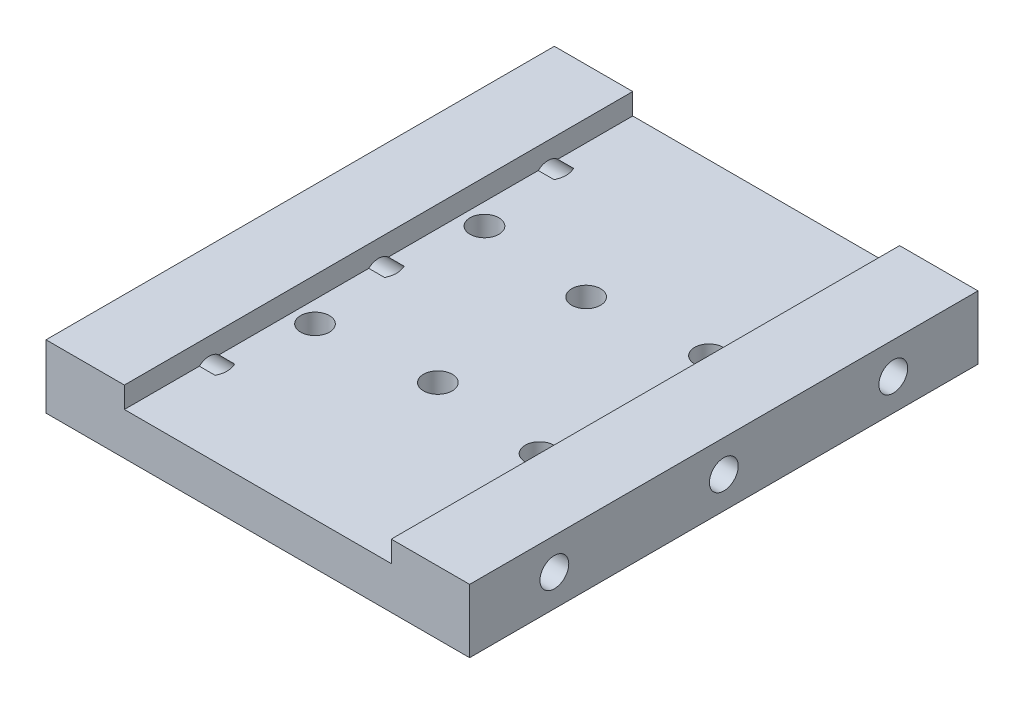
ISO-10303-21;
HEADER;
FILE_DESCRIPTION(('STEP AP214'),'2;1');
FILE_NAME('part.step','',(''),(''),'','','');
FILE_SCHEMA(('AUTOMOTIVE_DESIGN { 1 0 10303 214 1 1 1 1 }'));
ENDSEC;
DATA;
#1=APPLICATION_CONTEXT('core data for automotive mechanical design processes');
#2=APPLICATION_PROTOCOL_DEFINITION('international standard','automotive_design',2000,#1);
#3=PRODUCT_CONTEXT('',#1,'mechanical');
#4=PRODUCT('Part','Part','',(#3));
#5=PRODUCT_RELATED_PRODUCT_CATEGORY('part','',(#4));
#6=PRODUCT_DEFINITION_FORMATION('','',#4);
#7=PRODUCT_DEFINITION_CONTEXT('part definition',#1,'design');
#8=PRODUCT_DEFINITION('design','',#6,#7);
#9=PRODUCT_DEFINITION_SHAPE('','',#8);
#10=(LENGTH_UNIT() NAMED_UNIT(*) SI_UNIT(.MILLI.,.METRE.));
#11=(NAMED_UNIT(*) PLANE_ANGLE_UNIT() SI_UNIT($,.RADIAN.));
#12=(NAMED_UNIT(*) SI_UNIT($,.STERADIAN.) SOLID_ANGLE_UNIT());
#13=UNCERTAINTY_MEASURE_WITH_UNIT(LENGTH_MEASURE(1.E-05),#10,'distance_accuracy_value','');
#14=(GEOMETRIC_REPRESENTATION_CONTEXT(3) GLOBAL_UNCERTAINTY_ASSIGNED_CONTEXT((#13)) GLOBAL_UNIT_ASSIGNED_CONTEXT((#10,
#11,#12)) REPRESENTATION_CONTEXT('',''));
#15=CARTESIAN_POINT('',(0.,0.,0.));
#16=DIRECTION('',(0.,0.,1.));
#17=DIRECTION('',(1.,0.,0.));
#18=AXIS2_PLACEMENT_3D('',#15,#16,#17);
#19=CARTESIAN_POINT('',(-50.,15.,60.));
#20=DIRECTION('',(1.,0.,0.));
#21=DIRECTION('',(0.,0.,-1.));
#22=AXIS2_PLACEMENT_3D('',#19,#20,#21);
#23=PLANE('',#22);
#24=CARTESIAN_POINT('',(-50.,7.5,0.));
#25=DIRECTION('',(-1.,0.,0.));
#26=DIRECTION('',(0.,0.,1.));
#27=AXIS2_PLACEMENT_3D('',#24,#25,#26);
#28=CIRCLE('',#27,3.4);
#29=CARTESIAN_POINT('',(-50.,7.5,3.4));
#30=VERTEX_POINT('',#29);
#31=EDGE_CURVE('E198',#30,#30,#28,.T.);
#32=ORIENTED_EDGE('',*,*,#31,.F.);
#33=EDGE_LOOP('',(#32));
#34=FACE_BOUND('',#33,.T.);
#35=CARTESIAN_POINT('',(-50.,7.5,40.));
#36=DIRECTION('',(-1.,0.,0.));
#37=DIRECTION('',(0.,0.,1.));
#38=AXIS2_PLACEMENT_3D('',#35,#36,#37);
#39=CIRCLE('',#38,3.4);
#40=CARTESIAN_POINT('',(-50.,7.5,43.4));
#41=VERTEX_POINT('',#40);
#42=EDGE_CURVE('E218',#41,#41,#39,.T.);
#43=ORIENTED_EDGE('',*,*,#42,.F.);
#44=EDGE_LOOP('',(#43));
#45=FACE_BOUND('',#44,.T.);
#46=CARTESIAN_POINT('',(-50.,7.5,-40.));
#47=DIRECTION('',(-1.,0.,0.));
#48=DIRECTION('',(0.,0.,1.));
#49=AXIS2_PLACEMENT_3D('',#46,#47,#48);
#50=CIRCLE('',#49,3.4);
#51=CARTESIAN_POINT('',(-50.,7.5,-36.6));
#52=VERTEX_POINT('',#51);
#53=EDGE_CURVE('E228',#52,#52,#50,.T.);
#54=ORIENTED_EDGE('',*,*,#53,.F.);
#55=EDGE_LOOP('',(#54));
#56=FACE_BOUND('',#55,.T.);
#57=DIRECTION('',(0.,-1.,0.));
#58=VECTOR('',#57,1.);
#59=CARTESIAN_POINT('',(-50.,15.,-60.));
#60=LINE('',#59,#58);
#61=CARTESIAN_POINT('',(-50.,15.,-60.));
#62=VERTEX_POINT('',#61);
#63=CARTESIAN_POINT('',(-50.,0.,-60.));
#64=VERTEX_POINT('',#63);
#65=EDGE_CURVE('E260',#62,#64,#60,.T.);
#66=ORIENTED_EDGE('',*,*,#65,.T.);
#67=DIRECTION('',(0.,0.,-1.));
#68=VECTOR('',#67,1.);
#69=CARTESIAN_POINT('',(-50.,0.,60.));
#70=LINE('',#69,#68);
#71=CARTESIAN_POINT('',(-50.,0.,60.));
#72=VERTEX_POINT('',#71);
#73=EDGE_CURVE('E322',#72,#64,#70,.T.);
#74=ORIENTED_EDGE('',*,*,#73,.F.);
#75=DIRECTION('',(0.,-1.,0.));
#76=VECTOR('',#75,1.);
#77=CARTESIAN_POINT('',(-50.,15.,60.));
#78=LINE('',#77,#76);
#79=CARTESIAN_POINT('',(-50.,15.,60.));
#80=VERTEX_POINT('',#79);
#81=EDGE_CURVE('E279',#80,#72,#78,.T.);
#82=ORIENTED_EDGE('',*,*,#81,.F.);
#83=DIRECTION('',(0.,0.,-1.));
#84=VECTOR('',#83,1.);
#85=CARTESIAN_POINT('',(-50.,15.,60.));
#86=LINE('',#85,#84);
#87=EDGE_CURVE('E296',#80,#62,#86,.T.);
#88=ORIENTED_EDGE('',*,*,#87,.T.);
#89=EDGE_LOOP('',(#66,#74,#82,#88));
#90=FACE_BOUND('',#89,.T.);
#91=ADVANCED_FACE('F34',(#34,#45,#56,#90),#23,.F.);
#92=CARTESIAN_POINT('',(-50.,0.,60.));
#93=DIRECTION('',(0.,1.,0.));
#94=DIRECTION('',(0.,0.,1.));
#95=AXIS2_PLACEMENT_3D('',#92,#93,#94);
#96=PLANE('',#95);
#97=CARTESIAN_POINT('',(-26.5,0.,20.));
#98=DIRECTION('',(0.,-1.,0.));
#99=DIRECTION('',(0.,0.,-1.));
#100=AXIS2_PLACEMENT_3D('',#97,#98,#99);
#101=CIRCLE('',#100,3.39999999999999);
#102=CARTESIAN_POINT('',(-26.5,0.,16.6));
#103=VERTEX_POINT('',#102);
#104=EDGE_CURVE('E721',#103,#103,#101,.T.);
#105=ORIENTED_EDGE('',*,*,#104,.F.);
#106=EDGE_LOOP('',(#105));
#107=FACE_BOUND('',#106,.T.);
#108=CARTESIAN_POINT('',(-26.5,0.,-20.));
#109=DIRECTION('',(0.,-1.,0.));
#110=DIRECTION('',(0.,0.,-1.));
#111=AXIS2_PLACEMENT_3D('',#108,#109,#110);
#112=CIRCLE('',#111,3.39999999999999);
#113=CARTESIAN_POINT('',(-26.5,0.,-23.4));
#114=VERTEX_POINT('',#113);
#115=EDGE_CURVE('E712',#114,#114,#112,.T.);
#116=ORIENTED_EDGE('',*,*,#115,.F.);
#117=EDGE_LOOP('',(#116));
#118=FACE_BOUND('',#117,.T.);
#119=CARTESIAN_POINT('',(0.,0.,-17.5));
#120=DIRECTION('',(0.,-1.,0.));
#121=DIRECTION('',(0.,0.,-1.));
#122=AXIS2_PLACEMENT_3D('',#119,#120,#121);
#123=CIRCLE('',#122,3.39999999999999);
#124=CARTESIAN_POINT('',(0.,0.,-20.9));
#125=VERTEX_POINT('',#124);
#126=EDGE_CURVE('E709',#125,#125,#123,.T.);
#127=ORIENTED_EDGE('',*,*,#126,.F.);
#128=EDGE_LOOP('',(#127));
#129=FACE_BOUND('',#128,.T.);
#130=CARTESIAN_POINT('',(0.,0.,17.5));
#131=DIRECTION('',(0.,-1.,0.));
#132=DIRECTION('',(0.,0.,-1.));
#133=AXIS2_PLACEMENT_3D('',#130,#131,#132);
#134=CIRCLE('',#133,3.39999999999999);
#135=CARTESIAN_POINT('',(0.,0.,14.1));
#136=VERTEX_POINT('',#135);
#137=EDGE_CURVE('E706',#136,#136,#134,.T.);
#138=ORIENTED_EDGE('',*,*,#137,.F.);
#139=EDGE_LOOP('',(#138));
#140=FACE_BOUND('',#139,.T.);
#141=CARTESIAN_POINT('',(26.5,0.,20.));
#142=DIRECTION('',(0.,-1.,0.));
#143=DIRECTION('',(0.,0.,-1.));
#144=AXIS2_PLACEMENT_3D('',#141,#142,#143);
#145=CIRCLE('',#144,3.39999999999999);
#146=CARTESIAN_POINT('',(26.5,0.,16.6));
#147=VERTEX_POINT('',#146);
#148=EDGE_CURVE('E702',#147,#147,#145,.T.);
#149=ORIENTED_EDGE('',*,*,#148,.F.);
#150=EDGE_LOOP('',(#149));
#151=FACE_BOUND('',#150,.T.);
#152=CARTESIAN_POINT('',(26.5,0.,-20.));
#153=DIRECTION('',(0.,-1.,0.));
#154=DIRECTION('',(0.,0.,-1.));
#155=AXIS2_PLACEMENT_3D('',#152,#153,#154);
#156=CIRCLE('',#155,3.39999999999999);
#157=CARTESIAN_POINT('',(26.5,0.,-23.4));
#158=VERTEX_POINT('',#157);
#159=EDGE_CURVE('E698',#158,#158,#156,.T.);
#160=ORIENTED_EDGE('',*,*,#159,.F.);
#161=EDGE_LOOP('',(#160));
#162=FACE_BOUND('',#161,.T.);
#163=DIRECTION('',(1.,0.,0.));
#164=VECTOR('',#163,1.);
#165=CARTESIAN_POINT('',(-50.,0.,-60.));
#166=LINE('',#165,#164);
#167=CARTESIAN_POINT('',(50.,0.,-60.));
#168=VERTEX_POINT('',#167);
#169=EDGE_CURVE('E263',#64,#168,#166,.T.);
#170=ORIENTED_EDGE('',*,*,#169,.T.);
#171=DIRECTION('',(0.,0.,-1.));
#172=VECTOR('',#171,1.);
#173=CARTESIAN_POINT('',(50.,0.,60.));
#174=LINE('',#173,#172);
#175=CARTESIAN_POINT('',(50.,0.,60.));
#176=VERTEX_POINT('',#175);
#177=EDGE_CURVE('E319',#176,#168,#174,.T.);
#178=ORIENTED_EDGE('',*,*,#177,.F.);
#179=DIRECTION('',(1.,0.,0.));
#180=VECTOR('',#179,1.);
#181=CARTESIAN_POINT('',(-50.,0.,60.));
#182=LINE('',#181,#180);
#183=EDGE_CURVE('E282',#72,#176,#182,.T.);
#184=ORIENTED_EDGE('',*,*,#183,.F.);
#185=ORIENTED_EDGE('',*,*,#73,.T.);
#186=EDGE_LOOP('',(#170,#178,#184,#185));
#187=FACE_BOUND('',#186,.T.);
#188=ADVANCED_FACE('F423',(#107,#118,#129,#140,#151,#162,#187),#96,.F.);
#189=CARTESIAN_POINT('',(50.,15.,60.));
#190=DIRECTION('',(-1.,0.,0.));
#191=DIRECTION('',(0.,0.,1.));
#192=AXIS2_PLACEMENT_3D('',#189,#190,#191);
#193=PLANE('',#192);
#194=CARTESIAN_POINT('',(50.,7.5,0.));
#195=DIRECTION('',(1.,0.,0.));
#196=DIRECTION('',(0.,0.,-1.));
#197=AXIS2_PLACEMENT_3D('',#194,#195,#196);
#198=CIRCLE('',#197,3.4);
#199=CARTESIAN_POINT('',(50.,7.5,-3.4));
#200=VERTEX_POINT('',#199);
#201=EDGE_CURVE('E238',#200,#200,#198,.T.);
#202=ORIENTED_EDGE('',*,*,#201,.F.);
#203=EDGE_LOOP('',(#202));
#204=FACE_BOUND('',#203,.T.);
#205=CARTESIAN_POINT('',(50.,7.5,40.));
#206=DIRECTION('',(1.,0.,0.));
#207=DIRECTION('',(0.,0.,-1.));
#208=AXIS2_PLACEMENT_3D('',#205,#206,#207);
#209=CIRCLE('',#208,3.4);
#210=CARTESIAN_POINT('',(50.,7.5,36.6));
#211=VERTEX_POINT('',#210);
#212=EDGE_CURVE('E246',#211,#211,#209,.T.);
#213=ORIENTED_EDGE('',*,*,#212,.F.);
#214=EDGE_LOOP('',(#213));
#215=FACE_BOUND('',#214,.T.);
#216=CARTESIAN_POINT('',(50.,7.5,-40.));
#217=DIRECTION('',(1.,0.,0.));
#218=DIRECTION('',(0.,0.,-1.));
#219=AXIS2_PLACEMENT_3D('',#216,#217,#218);
#220=CIRCLE('',#219,3.4);
#221=CARTESIAN_POINT('',(50.,7.5,-43.4));
#222=VERTEX_POINT('',#221);
#223=EDGE_CURVE('E254',#222,#222,#220,.T.);
#224=ORIENTED_EDGE('',*,*,#223,.F.);
#225=EDGE_LOOP('',(#224));
#226=FACE_BOUND('',#225,.T.);
#227=DIRECTION('',(0.,1.,0.));
#228=VECTOR('',#227,1.);
#229=CARTESIAN_POINT('',(50.,15.,-60.));
#230=LINE('',#229,#228);
#231=CARTESIAN_POINT('',(50.,15.,-60.));
#232=VERTEX_POINT('',#231);
#233=EDGE_CURVE('E265',#168,#232,#230,.T.);
#234=ORIENTED_EDGE('',*,*,#233,.T.);
#235=DIRECTION('',(0.,0.,-1.));
#236=VECTOR('',#235,1.);
#237=CARTESIAN_POINT('',(50.,15.,60.));
#238=LINE('',#237,#236);
#239=CARTESIAN_POINT('',(50.,15.,60.));
#240=VERTEX_POINT('',#239);
#241=EDGE_CURVE('E316',#240,#232,#238,.T.);
#242=ORIENTED_EDGE('',*,*,#241,.F.);
#243=DIRECTION('',(0.,1.,0.));
#244=VECTOR('',#243,1.);
#245=CARTESIAN_POINT('',(50.,15.,60.));
#246=LINE('',#245,#244);
#247=EDGE_CURVE('E284',#176,#240,#246,.T.);
#248=ORIENTED_EDGE('',*,*,#247,.F.);
#249=ORIENTED_EDGE('',*,*,#177,.T.);
#250=EDGE_LOOP('',(#234,#242,#248,#249));
#251=FACE_BOUND('',#250,.T.);
#252=ADVANCED_FACE('F428',(#204,#215,#226,#251),#193,.F.);
#253=CARTESIAN_POINT('',(31.5,15.,60.));
#254=DIRECTION('',(0.,-1.,0.));
#255=DIRECTION('',(0.,0.,-1.));
#256=AXIS2_PLACEMENT_3D('',#253,#254,#255);
#257=PLANE('',#256);
#258=DIRECTION('',(-1.,0.,0.));
#259=VECTOR('',#258,1.);
#260=CARTESIAN_POINT('',(31.5,15.,-60.));
#261=LINE('',#260,#259);
#262=CARTESIAN_POINT('',(31.5,15.,-60.));
#263=VERTEX_POINT('',#262);
#264=EDGE_CURVE('E267',#232,#263,#261,.T.);
#265=ORIENTED_EDGE('',*,*,#264,.T.);
#266=DIRECTION('',(0.,0.,-1.));
#267=VECTOR('',#266,1.);
#268=CARTESIAN_POINT('',(31.5,15.,60.));
#269=LINE('',#268,#267);
#270=CARTESIAN_POINT('',(31.5,15.,60.));
#271=VERTEX_POINT('',#270);
#272=EDGE_CURVE('E311',#271,#263,#269,.T.);
#273=ORIENTED_EDGE('',*,*,#272,.F.);
#274=DIRECTION('',(-1.,0.,0.));
#275=VECTOR('',#274,1.);
#276=CARTESIAN_POINT('',(31.5,15.,60.));
#277=LINE('',#276,#275);
#278=EDGE_CURVE('E286',#240,#271,#277,.T.);
#279=ORIENTED_EDGE('',*,*,#278,.F.);
#280=ORIENTED_EDGE('',*,*,#241,.T.);
#281=EDGE_LOOP('',(#265,#273,#279,#280));
#282=FACE_BOUND('',#281,.T.);
#283=ADVANCED_FACE('F472',(#282),#257,.F.);
#284=CARTESIAN_POINT('',(31.5,15.,60.));
#285=DIRECTION('',(1.,0.,0.));
#286=DIRECTION('',(0.,0.,-1.));
#287=AXIS2_PLACEMENT_3D('',#284,#285,#286);
#288=PLANE('',#287);
#289=DIRECTION('',(0.,0.,-1.));
#290=VECTOR('',#289,1.);
#291=CARTESIAN_POINT('',(31.5,10.,60.));
#292=LINE('',#291,#290);
#293=CARTESIAN_POINT('',(31.5,10.,-2.30434372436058));
#294=VERTEX_POINT('',#293);
#295=CARTESIAN_POINT('',(31.5,10.,-37.6956562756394));
#296=VERTEX_POINT('',#295);
#297=EDGE_CURVE('E313',#294,#296,#292,.T.);
#298=ORIENTED_EDGE('',*,*,#297,.F.);
#299=CARTESIAN_POINT('',(31.5,7.5,0.));
#300=DIRECTION('',(1.,0.,0.));
#301=DIRECTION('',(0.,0.,-1.));
#302=AXIS2_PLACEMENT_3D('',#299,#300,#301);
#303=CIRCLE('',#302,3.4);
#304=CARTESIAN_POINT('',(31.5,10.,2.30434372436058));
#305=VERTEX_POINT('',#304);
#306=EDGE_CURVE('E241',#294,#305,#303,.T.);
#307=ORIENTED_EDGE('',*,*,#306,.T.);
#308=CARTESIAN_POINT('',(31.5,10.,37.6956562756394));
#309=VERTEX_POINT('',#308);
#310=EDGE_CURVE('E312',#309,#305,#292,.T.);
#311=ORIENTED_EDGE('',*,*,#310,.F.);
#312=CARTESIAN_POINT('',(31.5,7.5,40.));
#313=DIRECTION('',(1.,0.,0.));
#314=DIRECTION('',(0.,0.,-1.));
#315=AXIS2_PLACEMENT_3D('',#312,#313,#314);
#316=CIRCLE('',#315,3.4);
#317=CARTESIAN_POINT('',(31.5,10.,42.3043437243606));
#318=VERTEX_POINT('',#317);
#319=EDGE_CURVE('E249',#309,#318,#316,.T.);
#320=ORIENTED_EDGE('',*,*,#319,.T.);
#321=CARTESIAN_POINT('',(31.5,10.,60.));
#322=VERTEX_POINT('',#321);
#323=EDGE_CURVE('E308',#322,#318,#292,.T.);
#324=ORIENTED_EDGE('',*,*,#323,.F.);
#325=DIRECTION('',(0.,-1.,0.));
#326=VECTOR('',#325,1.);
#327=CARTESIAN_POINT('',(31.5,15.,60.));
#328=LINE('',#327,#326);
#329=EDGE_CURVE('E288',#271,#322,#328,.T.);
#330=ORIENTED_EDGE('',*,*,#329,.F.);
#331=ORIENTED_EDGE('',*,*,#272,.T.);
#332=DIRECTION('',(0.,-1.,0.));
#333=VECTOR('',#332,1.);
#334=CARTESIAN_POINT('',(31.5,15.,-60.));
#335=LINE('',#334,#333);
#336=CARTESIAN_POINT('',(31.5,10.,-60.));
#337=VERTEX_POINT('',#336);
#338=EDGE_CURVE('E269',#263,#337,#335,.T.);
#339=ORIENTED_EDGE('',*,*,#338,.T.);
#340=CARTESIAN_POINT('',(31.5,10.,-42.3043437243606));
#341=VERTEX_POINT('',#340);
#342=EDGE_CURVE('E306',#341,#337,#292,.T.);
#343=ORIENTED_EDGE('',*,*,#342,.F.);
#344=CARTESIAN_POINT('',(31.5,7.5,-40.));
#345=DIRECTION('',(1.,0.,0.));
#346=DIRECTION('',(0.,0.,-1.));
#347=AXIS2_PLACEMENT_3D('',#344,#345,#346);
#348=CIRCLE('',#347,3.4);
#349=EDGE_CURVE('E257',#341,#296,#348,.T.);
#350=ORIENTED_EDGE('',*,*,#349,.T.);
#351=EDGE_LOOP('',(#298,#307,#311,#320,#324,#330,#331,#339,#343,#350));
#352=FACE_BOUND('',#351,.T.);
#353=ADVANCED_FACE('F344',(#352),#288,.F.);
#354=CARTESIAN_POINT('',(-31.5,10.,60.));
#355=DIRECTION('',(0.,-1.,0.));
#356=DIRECTION('',(0.,0.,-1.));
#357=AXIS2_PLACEMENT_3D('',#354,#355,#356);
#358=PLANE('',#357);
#359=CARTESIAN_POINT('',(-26.5,10.,20.));
#360=DIRECTION('',(0.,-1.,0.));
#361=DIRECTION('',(0.,0.,-1.));
#362=AXIS2_PLACEMENT_3D('',#359,#360,#361);
#363=CIRCLE('',#362,3.39999999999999);
#364=CARTESIAN_POINT('',(-26.5,10.,16.6));
#365=VERTEX_POINT('',#364);
#366=EDGE_CURVE('E37',#365,#365,#363,.T.);
#367=ORIENTED_EDGE('',*,*,#366,.T.);
#368=EDGE_LOOP('',(#367));
#369=FACE_BOUND('',#368,.T.);
#370=CARTESIAN_POINT('',(-26.5,10.,-20.));
#371=DIRECTION('',(0.,-1.,0.));
#372=DIRECTION('',(0.,0.,-1.));
#373=AXIS2_PLACEMENT_3D('',#370,#371,#372);
#374=CIRCLE('',#373,3.39999999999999);
#375=CARTESIAN_POINT('',(-26.5,10.,-23.4));
#376=VERTEX_POINT('',#375);
#377=EDGE_CURVE('E710',#376,#376,#374,.T.);
#378=ORIENTED_EDGE('',*,*,#377,.T.);
#379=EDGE_LOOP('',(#378));
#380=FACE_BOUND('',#379,.T.);
#381=CARTESIAN_POINT('',(0.,10.,-17.5));
#382=DIRECTION('',(0.,-1.,0.));
#383=DIRECTION('',(0.,0.,-1.));
#384=AXIS2_PLACEMENT_3D('',#381,#382,#383);
#385=CIRCLE('',#384,3.39999999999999);
#386=CARTESIAN_POINT('',(0.,10.,-20.9));
#387=VERTEX_POINT('',#386);
#388=EDGE_CURVE('E707',#387,#387,#385,.T.);
#389=ORIENTED_EDGE('',*,*,#388,.T.);
#390=EDGE_LOOP('',(#389));
#391=FACE_BOUND('',#390,.T.);
#392=CARTESIAN_POINT('',(0.,10.,17.5));
#393=DIRECTION('',(0.,-1.,0.));
#394=DIRECTION('',(0.,0.,-1.));
#395=AXIS2_PLACEMENT_3D('',#392,#393,#394);
#396=CIRCLE('',#395,3.39999999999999);
#397=CARTESIAN_POINT('',(0.,10.,14.1));
#398=VERTEX_POINT('',#397);
#399=EDGE_CURVE('E703',#398,#398,#396,.T.);
#400=ORIENTED_EDGE('',*,*,#399,.T.);
#401=EDGE_LOOP('',(#400));
#402=FACE_BOUND('',#401,.T.);
#403=CARTESIAN_POINT('',(26.5,10.,20.));
#404=DIRECTION('',(0.,-1.,0.));
#405=DIRECTION('',(0.,0.,-1.));
#406=AXIS2_PLACEMENT_3D('',#403,#404,#405);
#407=CIRCLE('',#406,3.39999999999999);
#408=CARTESIAN_POINT('',(26.5,10.,16.6));
#409=VERTEX_POINT('',#408);
#410=EDGE_CURVE('E699',#409,#409,#407,.T.);
#411=ORIENTED_EDGE('',*,*,#410,.T.);
#412=EDGE_LOOP('',(#411));
#413=FACE_BOUND('',#412,.T.);
#414=CARTESIAN_POINT('',(26.5,10.,-20.));
#415=DIRECTION('',(0.,-1.,0.));
#416=DIRECTION('',(0.,0.,-1.));
#417=AXIS2_PLACEMENT_3D('',#414,#415,#416);
#418=CIRCLE('',#417,3.39999999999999);
#419=CARTESIAN_POINT('',(26.5,10.,-23.4));
#420=VERTEX_POINT('',#419);
#421=EDGE_CURVE('E199',#420,#420,#418,.T.);
#422=ORIENTED_EDGE('',*,*,#421,.T.);
#423=EDGE_LOOP('',(#422));
#424=FACE_BOUND('',#423,.T.);
#425=CARTESIAN_POINT('',(-35.9882104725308,10.,-16.9270650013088));
#426=CARTESIAN_POINT('',(-35.6939365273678,10.,-16.4319748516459));
#427=CARTESIAN_POINT('',(-35.3998467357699,10.,-15.9367749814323));
#428=CARTESIAN_POINT('',(-34.8120679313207,10.,-14.9458223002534));
#429=CARTESIAN_POINT('',(-34.5183791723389,10.,-14.4500693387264));
#430=CARTESIAN_POINT('',(-33.929176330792,10.,-13.4538551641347));
#431=CARTESIAN_POINT('',(-33.6336684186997,10.,-12.9533903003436));
#432=CARTESIAN_POINT('',(-33.0437991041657,10.,-11.952099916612));
#433=CARTESIAN_POINT('',(-32.7494372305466,10.,-11.4512746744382));
#434=CARTESIAN_POINT('',(-32.2403106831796,10.,-10.5821394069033));
#435=CARTESIAN_POINT('',(-32.0252074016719,10.,-10.2140278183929));
#436=CARTESIAN_POINT('',(-31.5960688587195,10.,-9.47715905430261));
#437=CARTESIAN_POINT('',(-31.3820336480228,10.,-9.10840184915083));
#438=CARTESIAN_POINT('',(-30.9551166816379,10.,-8.36939721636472));
#439=CARTESIAN_POINT('',(-30.7422374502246,10.,-7.99914832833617));
#440=CARTESIAN_POINT('',(-30.3187395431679,10.,-7.25744579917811));
#441=CARTESIAN_POINT('',(-30.108120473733,10.,-6.8859923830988));
#442=CARTESIAN_POINT('',(-29.6917448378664,10.,-6.14377703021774));
#443=CARTESIAN_POINT('',(-29.4859645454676,10.,-5.77302847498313));
#444=CARTESIAN_POINT('',(-29.18141993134,10.,-5.21448036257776));
#445=CARTESIAN_POINT('',(-29.0805573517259,10.,-5.02782623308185));
#446=CARTESIAN_POINT('',(-28.8807212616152,10.,-4.65351581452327));
#447=CARTESIAN_POINT('',(-28.7817476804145,10.,-4.4658595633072));
#448=CARTESIAN_POINT('',(-28.5866733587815,10.,-4.08982116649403));
#449=CARTESIAN_POINT('',(-28.4905644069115,10.,-3.90144329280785));
#450=CARTESIAN_POINT('',(-28.3018877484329,10.,-3.52287012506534));
#451=CARTESIAN_POINT('',(-28.2093206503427,10.,-3.33267452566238));
#452=CARTESIAN_POINT('',(-28.0294462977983,10.,-2.95008807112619));
#453=CARTESIAN_POINT('',(-27.9421326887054,10.,-2.75770021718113));
#454=CARTESIAN_POINT('',(-27.7751835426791,10.,-2.36963710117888));
#455=CARTESIAN_POINT('',(-27.6955447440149,10.,-2.17396327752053));
#456=CARTESIAN_POINT('',(-27.6090321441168,10.,-1.94175350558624));
#457=CARTESIAN_POINT('',(-27.5964170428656,10.,-1.9073484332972));
#458=CARTESIAN_POINT('',(-27.5715760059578,10.,-1.83839609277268));
#459=CARTESIAN_POINT('',(-27.5593500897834,10.,-1.80384881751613));
#460=CARTESIAN_POINT('',(-27.5232980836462,10.,-1.69998177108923));
#461=CARTESIAN_POINT('',(-27.500099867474,10.,-1.63044247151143));
#462=CARTESIAN_POINT('',(-27.4556546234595,10.,-1.49075426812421));
#463=CARTESIAN_POINT('',(-27.4344072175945,10.,-1.42060548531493));
#464=CARTESIAN_POINT('',(-27.3941662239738,10.,-1.27966704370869));
#465=CARTESIAN_POINT('',(-27.3751726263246,10.,-1.20887738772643));
#466=CARTESIAN_POINT('',(-27.3230526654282,10.,-0.999461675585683));
#467=CARTESIAN_POINT('',(-27.2935187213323,10.,-0.859905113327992));
#468=CARTESIAN_POINT('',(-27.2468103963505,10.,-0.578683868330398));
#469=CARTESIAN_POINT('',(-27.2296358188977,10.,-0.437019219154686));
#470=CARTESIAN_POINT('',(-27.2095385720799,10.,-0.151272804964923));
#471=CARTESIAN_POINT('',(-27.2067539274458,10.,-0.00718088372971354));
#472=CARTESIAN_POINT('',(-27.2161808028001,10.,0.280456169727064));
#473=CARTESIAN_POINT('',(-27.2283892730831,10.,0.424001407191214));
#474=CARTESIAN_POINT('',(-27.2667026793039,10.,0.712574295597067));
#475=CARTESIAN_POINT('',(-27.2931244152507,10.,0.857558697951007));
#476=CARTESIAN_POINT('',(-27.3412652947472,10.,1.07308637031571));
#477=CARTESIAN_POINT('',(-27.3587370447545,10.,1.14462600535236));
#478=CARTESIAN_POINT('',(-27.3961659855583,10.,1.2870500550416));
#479=CARTESIAN_POINT('',(-27.4161230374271,10.,1.35793450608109));
#480=CARTESIAN_POINT('',(-27.4740283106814,10.,1.55219433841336));
#481=CARTESIAN_POINT('',(-27.5142081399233,10.,1.67490365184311));
#482=CARTESIAN_POINT('',(-27.5996475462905,10.,1.918553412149));
#483=CARTESIAN_POINT('',(-27.6449086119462,10.,2.03949332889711));
#484=CARTESIAN_POINT('',(-27.7393664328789,10.,2.27996871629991));
#485=CARTESIAN_POINT('',(-27.788567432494,10.,2.39950250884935));
#486=CARTESIAN_POINT('',(-27.8899599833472,10.,2.63727279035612));
#487=CARTESIAN_POINT('',(-27.9421512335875,10.,2.75550940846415));
#488=CARTESIAN_POINT('',(-28.0491084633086,10.,2.9914663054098));
#489=CARTESIAN_POINT('',(-28.1038852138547,10.,3.10918168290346));
#490=CARTESIAN_POINT('',(-28.2152920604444,10.,3.34373384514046));
#491=CARTESIAN_POINT('',(-28.2719222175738,10.,3.46057060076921));
#492=CARTESIAN_POINT('',(-28.4439321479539,10.,3.80985522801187));
#493=CARTESIAN_POINT('',(-28.5614993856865,10.,4.04122475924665));
#494=CARTESIAN_POINT('',(-28.7885979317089,10.,4.47912499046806));
#495=CARTESIAN_POINT('',(-28.8977700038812,10.,4.68584361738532));
#496=CARTESIAN_POINT('',(-29.1183570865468,10.,5.09812319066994));
#497=CARTESIAN_POINT('',(-29.2297724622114,10.,5.30368394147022));
#498=CARTESIAN_POINT('',(-29.4531272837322,10.,5.71189996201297));
#499=CARTESIAN_POINT('',(-29.565050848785,10.,5.91456394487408));
#500=CARTESIAN_POINT('',(-29.7901043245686,10.,6.31916513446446));
#501=CARTESIAN_POINT('',(-29.9032339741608,10.,6.52110248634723));
#502=CARTESIAN_POINT('',(-30.0167967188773,10.,6.72279337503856));
#503=B_SPLINE_CURVE_WITH_KNOTS('',3,(#425,#426,#427,#428,#429,#430,#431,#432,#433,#434,#435,
#436,#437,#438,#439,#440,#441,#442,#443,#444,#445,#446,#447,#448,#449,#450,#451,#452,#453,#454,
#455,#456,#457,#458,#459,#460,#461,#462,#463,#464,#465,#466,#467,#468,#469,#470,#471,#472,#473,
#474,#475,#476,#477,#478,#479,#480,#481,#482,#483,#484,#485,#486,#487,#488,#489,#490,#491,#492,
#493,#494,#495,#496,#497,#498,#499,#500,#501,#502),.UNSPECIFIED.,.F.,.F.,(4,2,2,2,2,2,2,2,2,2,2,
2,2,2,2,2,2,2,2,2,2,2,2,2,2,2,2,2,2,2,2,2,2,2,2,2,2,2,4),(0.,1.72783209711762,3.45647764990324,
5.20006801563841,6.94284371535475,8.22189675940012,9.50101000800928,10.7822601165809,
12.0632832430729,13.3353333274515,13.9718139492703,14.6082707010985,15.2426817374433,
15.8772012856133,16.5109372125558,17.1444026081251,17.2543354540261,17.3642737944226,
17.584168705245,17.8040209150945,18.0238721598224,18.4513426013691,18.8788062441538,
19.3103625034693,19.7418309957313,20.1833410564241,20.4042332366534,20.6251130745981,
21.0123138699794,21.3996283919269,21.787365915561,22.1750644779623,22.5645523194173,
22.9540530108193,23.7325678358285,24.4338813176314,25.1353098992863,25.8298529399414,
26.5242485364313),.UNSPECIFIED.);
#504=CARTESIAN_POINT('',(-27.75,10.,-2.30434372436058));
#505=VERTEX_POINT('',#504);
#506=CARTESIAN_POINT('',(-27.75,10.,2.30434372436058));
#507=VERTEX_POINT('',#506);
#508=EDGE_CURVE('E11',#505,#507,#503,.T.);
#509=ORIENTED_EDGE('',*,*,#508,.T.);
#510=DIRECTION('',(-1.,0.,0.));
#511=VECTOR('',#510,1.);
#512=CARTESIAN_POINT('',(-50.,10.,2.30434372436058));
#513=LINE('',#512,#511);
#514=CARTESIAN_POINT('',(-31.5,10.,2.30434372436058));
#515=VERTEX_POINT('',#514);
#516=EDGE_CURVE('E205',#507,#515,#513,.T.);
#517=ORIENTED_EDGE('',*,*,#516,.T.);
#518=DIRECTION('',(0.,0.,-1.));
#519=VECTOR('',#518,1.);
#520=CARTESIAN_POINT('',(-31.5,10.,60.));
#521=LINE('',#520,#519);
#522=CARTESIAN_POINT('',(-31.5,10.,37.6956562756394));
#523=VERTEX_POINT('',#522);
#524=EDGE_CURVE('E307',#523,#515,#521,.T.);
#525=ORIENTED_EDGE('',*,*,#524,.F.);
#526=DIRECTION('',(-1.,0.,0.));
#527=VECTOR('',#526,1.);
#528=CARTESIAN_POINT('',(-50.,10.,37.6956562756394));
#529=LINE('',#528,#527);
#530=CARTESIAN_POINT('',(-27.75,10.,37.6956562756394));
#531=VERTEX_POINT('',#530);
#532=EDGE_CURVE('E58',#523,#531,#529,.F.);
#533=ORIENTED_EDGE('',*,*,#532,.T.);
#534=CARTESIAN_POINT('',(-35.9882104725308,10.,23.0729349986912));
#535=CARTESIAN_POINT('',(-35.6939365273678,10.,23.5680251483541));
#536=CARTESIAN_POINT('',(-35.3998467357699,10.,24.0632250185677));
#537=CARTESIAN_POINT('',(-34.8120679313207,10.,25.0541776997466));
#538=CARTESIAN_POINT('',(-34.5183791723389,10.,25.5499306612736));
#539=CARTESIAN_POINT('',(-33.929176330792,10.,26.5461448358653));
#540=CARTESIAN_POINT('',(-33.6336684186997,10.,27.0466096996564));
#541=CARTESIAN_POINT('',(-33.0437991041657,10.,28.047900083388));
#542=CARTESIAN_POINT('',(-32.7494372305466,10.,28.5487253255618));
#543=CARTESIAN_POINT('',(-32.2403106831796,10.,29.4178605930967));
#544=CARTESIAN_POINT('',(-32.0252074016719,10.,29.7859721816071));
#545=CARTESIAN_POINT('',(-31.5960688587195,10.,30.5228409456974));
#546=CARTESIAN_POINT('',(-31.3820336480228,10.,30.8915981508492));
#547=CARTESIAN_POINT('',(-30.9551166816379,10.,31.6306027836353));
#548=CARTESIAN_POINT('',(-30.7422374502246,10.,32.0008516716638));
#549=CARTESIAN_POINT('',(-30.3187395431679,10.,32.7425542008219));
#550=CARTESIAN_POINT('',(-30.108120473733,10.,33.1140076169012));
#551=CARTESIAN_POINT('',(-29.6917448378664,10.,33.8562229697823));
#552=CARTESIAN_POINT('',(-29.4859645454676,10.,34.2269715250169));
#553=CARTESIAN_POINT('',(-29.18141993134,10.,34.7855196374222));
#554=CARTESIAN_POINT('',(-29.0805573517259,10.,34.9721737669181));
#555=CARTESIAN_POINT('',(-28.8807212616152,10.,35.3464841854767));
#556=CARTESIAN_POINT('',(-28.7817476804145,10.,35.5341404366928));
#557=CARTESIAN_POINT('',(-28.5866733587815,10.,35.910178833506));
#558=CARTESIAN_POINT('',(-28.4905644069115,10.,36.0985567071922));
#559=CARTESIAN_POINT('',(-28.3018877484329,10.,36.4771298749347));
#560=CARTESIAN_POINT('',(-28.2093206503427,10.,36.6673254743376));
#561=CARTESIAN_POINT('',(-28.0294462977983,10.,37.0499119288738));
#562=CARTESIAN_POINT('',(-27.9421326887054,10.,37.2422997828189));
#563=CARTESIAN_POINT('',(-27.7751835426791,10.,37.6303628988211));
#564=CARTESIAN_POINT('',(-27.6955447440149,10.,37.8260367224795));
#565=CARTESIAN_POINT('',(-27.6090321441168,10.,38.0582464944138));
#566=CARTESIAN_POINT('',(-27.5964170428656,10.,38.0926515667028));
#567=CARTESIAN_POINT('',(-27.5715760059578,10.,38.1616039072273));
#568=CARTESIAN_POINT('',(-27.5593500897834,10.,38.1961511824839));
#569=CARTESIAN_POINT('',(-27.5232980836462,10.,38.3000182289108));
#570=CARTESIAN_POINT('',(-27.500099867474,10.,38.3695575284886));
#571=CARTESIAN_POINT('',(-27.4556546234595,10.,38.5092457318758));
#572=CARTESIAN_POINT('',(-27.4344072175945,10.,38.5793945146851));
#573=CARTESIAN_POINT('',(-27.3941662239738,10.,38.7203329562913));
#574=CARTESIAN_POINT('',(-27.3751726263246,10.,38.7911226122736));
#575=CARTESIAN_POINT('',(-27.3230526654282,10.,39.0005383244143));
#576=CARTESIAN_POINT('',(-27.2935187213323,10.,39.140094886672));
#577=CARTESIAN_POINT('',(-27.2468103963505,10.,39.4213161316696));
#578=CARTESIAN_POINT('',(-27.2296358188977,10.,39.5629807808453));
#579=CARTESIAN_POINT('',(-27.2095385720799,10.,39.8487271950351));
#580=CARTESIAN_POINT('',(-27.2067539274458,10.,39.9928191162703));
#581=CARTESIAN_POINT('',(-27.2161808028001,10.,40.2804561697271));
#582=CARTESIAN_POINT('',(-27.2283892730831,10.,40.4240014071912));
#583=CARTESIAN_POINT('',(-27.2667026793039,10.,40.7125742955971));
#584=CARTESIAN_POINT('',(-27.2931244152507,10.,40.857558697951));
#585=CARTESIAN_POINT('',(-27.3412652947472,10.,41.0730863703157));
#586=CARTESIAN_POINT('',(-27.3587370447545,10.,41.1446260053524));
#587=CARTESIAN_POINT('',(-27.3961659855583,10.,41.2870500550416));
#588=CARTESIAN_POINT('',(-27.4161230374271,10.,41.3579345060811));
#589=CARTESIAN_POINT('',(-27.4740283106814,10.,41.5521943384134));
#590=CARTESIAN_POINT('',(-27.5142081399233,10.,41.6749036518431));
#591=CARTESIAN_POINT('',(-27.5996475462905,10.,41.918553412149));
#592=CARTESIAN_POINT('',(-27.6449086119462,10.,42.0394933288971));
#593=CARTESIAN_POINT('',(-27.7393664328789,10.,42.2799687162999));
#594=CARTESIAN_POINT('',(-27.7885674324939,10.,42.3995025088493));
#595=CARTESIAN_POINT('',(-27.8899599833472,10.,42.6372727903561));
#596=CARTESIAN_POINT('',(-27.9421512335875,10.,42.7555094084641));
#597=CARTESIAN_POINT('',(-28.0491084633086,10.,42.9914663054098));
#598=CARTESIAN_POINT('',(-28.1038852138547,10.,43.1091816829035));
#599=CARTESIAN_POINT('',(-28.2152920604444,10.,43.3437338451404));
#600=CARTESIAN_POINT('',(-28.2719222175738,10.,43.4605706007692));
#601=CARTESIAN_POINT('',(-28.4439321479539,10.,43.8098552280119));
#602=CARTESIAN_POINT('',(-28.5614993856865,10.,44.0412247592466));
#603=CARTESIAN_POINT('',(-28.7885979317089,10.,44.4791249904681));
#604=CARTESIAN_POINT('',(-28.8977700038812,10.,44.6858436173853));
#605=CARTESIAN_POINT('',(-29.1183570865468,10.,45.0981231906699));
#606=CARTESIAN_POINT('',(-29.2297724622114,10.,45.3036839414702));
#607=CARTESIAN_POINT('',(-29.4531272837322,10.,45.711899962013));
#608=CARTESIAN_POINT('',(-29.565050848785,10.,45.9145639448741));
#609=CARTESIAN_POINT('',(-29.7901043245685,10.,46.3191651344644));
#610=CARTESIAN_POINT('',(-29.9032339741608,10.,46.5211024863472));
#611=CARTESIAN_POINT('',(-30.0167967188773,10.,46.7227933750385));
#612=B_SPLINE_CURVE_WITH_KNOTS('',3,(#534,#535,#536,#537,#538,#539,#540,#541,#542,#543,#544,
#545,#546,#547,#548,#549,#550,#551,#552,#553,#554,#555,#556,#557,#558,#559,#560,#561,#562,#563,
#564,#565,#566,#567,#568,#569,#570,#571,#572,#573,#574,#575,#576,#577,#578,#579,#580,#581,#582,
#583,#584,#585,#586,#587,#588,#589,#590,#591,#592,#593,#594,#595,#596,#597,#598,#599,#600,#601,
#602,#603,#604,#605,#606,#607,#608,#609,#610,#611),.UNSPECIFIED.,.F.,.F.,(4,2,2,2,2,2,2,2,2,2,2,
2,2,2,2,2,2,2,2,2,2,2,2,2,2,2,2,2,2,2,2,2,2,2,2,2,2,2,4),(0.,1.72783209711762,3.45647764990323,
5.2000680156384,6.94284371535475,8.22189675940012,9.50101000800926,10.7822601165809,
12.0632832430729,13.3353333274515,13.9718139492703,14.6082707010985,15.2426817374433,
15.8772012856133,16.5109372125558,17.1444026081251,17.2543354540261,17.3642737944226,
17.5841687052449,17.8040209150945,18.0238721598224,18.451342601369,18.8788062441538,
19.3103625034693,19.7418309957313,20.1833410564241,20.4042332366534,20.6251130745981,
21.0123138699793,21.3996283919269,21.787365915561,22.1750644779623,22.5645523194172,
22.9540530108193,23.7325678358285,24.4338813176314,25.1353098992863,25.8298529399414,
26.5242485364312),.UNSPECIFIED.);
#613=CARTESIAN_POINT('',(-27.75,10.,42.3043437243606));
#614=VERTEX_POINT('',#613);
#615=EDGE_CURVE('E377',#531,#614,#612,.T.);
#616=ORIENTED_EDGE('',*,*,#615,.T.);
#617=DIRECTION('',(-1.,0.,0.));
#618=VECTOR('',#617,1.);
#619=CARTESIAN_POINT('',(-50.,10.,42.3043437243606));
#620=LINE('',#619,#618);
#621=CARTESIAN_POINT('',(-31.5,10.,42.3043437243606));
#622=VERTEX_POINT('',#621);
#623=EDGE_CURVE('E222',#614,#622,#620,.T.);
#624=ORIENTED_EDGE('',*,*,#623,.T.);
#625=CARTESIAN_POINT('',(-31.5,10.,60.));
#626=VERTEX_POINT('',#625);
#627=EDGE_CURVE('E303',#626,#622,#521,.T.);
#628=ORIENTED_EDGE('',*,*,#627,.F.);
#629=DIRECTION('',(-1.,0.,0.));
#630=VECTOR('',#629,1.);
#631=CARTESIAN_POINT('',(-31.5,10.,60.));
#632=LINE('',#631,#630);
#633=EDGE_CURVE('E290',#322,#626,#632,.T.);
#634=ORIENTED_EDGE('',*,*,#633,.F.);
#635=ORIENTED_EDGE('',*,*,#323,.T.);
#636=DIRECTION('',(1.,0.,0.));
#637=VECTOR('',#636,1.);
#638=CARTESIAN_POINT('',(50.,10.,42.3043437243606));
#639=LINE('',#638,#637);
#640=CARTESIAN_POINT('',(27.75,10.,42.3043437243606));
#641=VERTEX_POINT('',#640);
#642=EDGE_CURVE('E494',#318,#641,#639,.F.);
#643=ORIENTED_EDGE('',*,*,#642,.T.);
#644=CARTESIAN_POINT('',(35.9882104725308,10.,23.0729349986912));
#645=CARTESIAN_POINT('',(35.6939365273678,10.,23.5680251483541));
#646=CARTESIAN_POINT('',(35.3998467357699,10.,24.0632250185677));
#647=CARTESIAN_POINT('',(34.8120679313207,10.,25.0541776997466));
#648=CARTESIAN_POINT('',(34.5183791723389,10.,25.5499306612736));
#649=CARTESIAN_POINT('',(33.929176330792,10.,26.5461448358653));
#650=CARTESIAN_POINT('',(33.6336684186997,10.,27.0466096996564));
#651=CARTESIAN_POINT('',(33.0437991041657,10.,28.047900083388));
#652=CARTESIAN_POINT('',(32.7494372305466,10.,28.5487253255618));
#653=CARTESIAN_POINT('',(32.2403106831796,10.,29.4178605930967));
#654=CARTESIAN_POINT('',(32.0252074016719,10.,29.7859721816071));
#655=CARTESIAN_POINT('',(31.5960688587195,10.,30.5228409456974));
#656=CARTESIAN_POINT('',(31.3820336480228,10.,30.8915981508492));
#657=CARTESIAN_POINT('',(30.9551166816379,10.,31.6306027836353));
#658=CARTESIAN_POINT('',(30.7422374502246,10.,32.0008516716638));
#659=CARTESIAN_POINT('',(30.3187395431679,10.,32.7425542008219));
#660=CARTESIAN_POINT('',(30.108120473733,10.,33.1140076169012));
#661=CARTESIAN_POINT('',(29.6917448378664,10.,33.8562229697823));
#662=CARTESIAN_POINT('',(29.4859645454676,10.,34.2269715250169));
#663=CARTESIAN_POINT('',(29.18141993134,10.,34.7855196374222));
#664=CARTESIAN_POINT('',(29.0805573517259,10.,34.9721737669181));
#665=CARTESIAN_POINT('',(28.8807212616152,10.,35.3464841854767));
#666=CARTESIAN_POINT('',(28.7817476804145,10.,35.5341404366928));
#667=CARTESIAN_POINT('',(28.5866733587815,10.,35.910178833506));
#668=CARTESIAN_POINT('',(28.4905644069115,10.,36.0985567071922));
#669=CARTESIAN_POINT('',(28.3018877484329,10.,36.4771298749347));
#670=CARTESIAN_POINT('',(28.2093206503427,10.,36.6673254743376));
#671=CARTESIAN_POINT('',(28.0294462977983,10.,37.0499119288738));
#672=CARTESIAN_POINT('',(27.9421326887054,10.,37.2422997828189));
#673=CARTESIAN_POINT('',(27.7751835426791,10.,37.6303628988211));
#674=CARTESIAN_POINT('',(27.6955447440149,10.,37.8260367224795));
#675=CARTESIAN_POINT('',(27.6090321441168,10.,38.0582464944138));
#676=CARTESIAN_POINT('',(27.5964170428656,10.,38.0926515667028));
#677=CARTESIAN_POINT('',(27.5715760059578,10.,38.1616039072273));
#678=CARTESIAN_POINT('',(27.5593500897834,10.,38.1961511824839));
#679=CARTESIAN_POINT('',(27.5232980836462,10.,38.3000182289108));
#680=CARTESIAN_POINT('',(27.500099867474,10.,38.3695575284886));
#681=CARTESIAN_POINT('',(27.4556546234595,10.,38.5092457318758));
#682=CARTESIAN_POINT('',(27.4344072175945,10.,38.5793945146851));
#683=CARTESIAN_POINT('',(27.3941662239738,10.,38.7203329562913));
#684=CARTESIAN_POINT('',(27.3751726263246,10.,38.7911226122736));
#685=CARTESIAN_POINT('',(27.3230526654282,10.,39.0005383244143));
#686=CARTESIAN_POINT('',(27.2935187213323,10.,39.140094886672));
#687=CARTESIAN_POINT('',(27.2468103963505,10.,39.4213161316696));
#688=CARTESIAN_POINT('',(27.2296358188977,10.,39.5629807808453));
#689=CARTESIAN_POINT('',(27.2095385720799,10.,39.8487271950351));
#690=CARTESIAN_POINT('',(27.2067539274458,10.,39.9928191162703));
#691=CARTESIAN_POINT('',(27.2161808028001,10.,40.2804561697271));
#692=CARTESIAN_POINT('',(27.2283892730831,10.,40.4240014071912));
#693=CARTESIAN_POINT('',(27.2667026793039,10.,40.7125742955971));
#694=CARTESIAN_POINT('',(27.2931244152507,10.,40.857558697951));
#695=CARTESIAN_POINT('',(27.3412652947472,10.,41.0730863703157));
#696=CARTESIAN_POINT('',(27.3587370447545,10.,41.1446260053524));
#697=CARTESIAN_POINT('',(27.3961659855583,10.,41.2870500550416));
#698=CARTESIAN_POINT('',(27.4161230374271,10.,41.3579345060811));
#699=CARTESIAN_POINT('',(27.4740283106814,10.,41.5521943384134));
#700=CARTESIAN_POINT('',(27.5142081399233,10.,41.6749036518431));
#701=CARTESIAN_POINT('',(27.5996475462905,10.,41.918553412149));
#702=CARTESIAN_POINT('',(27.6449086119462,10.,42.0394933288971));
#703=CARTESIAN_POINT('',(27.7393664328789,10.,42.2799687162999));
#704=CARTESIAN_POINT('',(27.7885674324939,10.,42.3995025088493));
#705=CARTESIAN_POINT('',(27.8899599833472,10.,42.6372727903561));
#706=CARTESIAN_POINT('',(27.9421512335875,10.,42.7555094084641));
#707=CARTESIAN_POINT('',(28.0491084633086,10.,42.9914663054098));
#708=CARTESIAN_POINT('',(28.1038852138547,10.,43.1091816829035));
#709=CARTESIAN_POINT('',(28.2152920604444,10.,43.3437338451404));
#710=CARTESIAN_POINT('',(28.2719222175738,10.,43.4605706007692));
#711=CARTESIAN_POINT('',(28.4439321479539,10.,43.8098552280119));
#712=CARTESIAN_POINT('',(28.5614993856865,10.,44.0412247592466));
#713=CARTESIAN_POINT('',(28.7885979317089,10.,44.4791249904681));
#714=CARTESIAN_POINT('',(28.8977700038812,10.,44.6858436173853));
#715=CARTESIAN_POINT('',(29.1183570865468,10.,45.0981231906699));
#716=CARTESIAN_POINT('',(29.2297724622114,10.,45.3036839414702));
#717=CARTESIAN_POINT('',(29.4531272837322,10.,45.711899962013));
#718=CARTESIAN_POINT('',(29.565050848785,10.,45.9145639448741));
#719=CARTESIAN_POINT('',(29.7901043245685,10.,46.3191651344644));
#720=CARTESIAN_POINT('',(29.9032339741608,10.,46.5211024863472));
#721=CARTESIAN_POINT('',(30.0167967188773,10.,46.7227933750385));
#722=B_SPLINE_CURVE_WITH_KNOTS('',3,(#644,#645,#646,#647,#648,#649,#650,#651,#652,#653,#654,
#655,#656,#657,#658,#659,#660,#661,#662,#663,#664,#665,#666,#667,#668,#669,#670,#671,#672,#673,
#674,#675,#676,#677,#678,#679,#680,#681,#682,#683,#684,#685,#686,#687,#688,#689,#690,#691,#692,
#693,#694,#695,#696,#697,#698,#699,#700,#701,#702,#703,#704,#705,#706,#707,#708,#709,#710,#711,
#712,#713,#714,#715,#716,#717,#718,#719,#720,#721),.UNSPECIFIED.,.F.,.F.,(4,2,2,2,2,2,2,2,2,2,2,
2,2,2,2,2,2,2,2,2,2,2,2,2,2,2,2,2,2,2,2,2,2,2,2,2,2,2,4),(0.,1.72783209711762,3.45647764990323,
5.2000680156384,6.94284371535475,8.22189675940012,9.50101000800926,10.7822601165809,
12.0632832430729,13.3353333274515,13.9718139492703,14.6082707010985,15.2426817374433,
15.8772012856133,16.5109372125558,17.1444026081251,17.2543354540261,17.3642737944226,
17.5841687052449,17.8040209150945,18.0238721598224,18.451342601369,18.8788062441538,
19.3103625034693,19.7418309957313,20.1833410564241,20.4042332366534,20.6251130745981,
21.0123138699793,21.3996283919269,21.787365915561,22.1750644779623,22.5645523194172,
22.9540530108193,23.7325678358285,24.4338813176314,25.1353098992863,25.8298529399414,
26.5242485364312),.UNSPECIFIED.);
#723=CARTESIAN_POINT('',(27.75,10.,37.6956562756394));
#724=VERTEX_POINT('',#723);
#725=EDGE_CURVE('E353',#641,#724,#722,.F.);
#726=ORIENTED_EDGE('',*,*,#725,.T.);
#727=DIRECTION('',(1.,0.,0.));
#728=VECTOR('',#727,1.);
#729=CARTESIAN_POINT('',(50.,10.,37.6956562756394));
#730=LINE('',#729,#728);
#731=EDGE_CURVE('E492',#724,#309,#730,.T.);
#732=ORIENTED_EDGE('',*,*,#731,.T.);
#733=ORIENTED_EDGE('',*,*,#310,.T.);
#734=DIRECTION('',(1.,0.,0.));
#735=VECTOR('',#734,1.);
#736=CARTESIAN_POINT('',(50.,10.,2.30434372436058));
#737=LINE('',#736,#735);
#738=CARTESIAN_POINT('',(27.75,10.,2.30434372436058));
#739=VERTEX_POINT('',#738);
#740=EDGE_CURVE('E487',#305,#739,#737,.F.);
#741=ORIENTED_EDGE('',*,*,#740,.T.);
#742=CARTESIAN_POINT('',(35.9882104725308,10.,-16.9270650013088));
#743=CARTESIAN_POINT('',(35.6939365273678,10.,-16.4319748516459));
#744=CARTESIAN_POINT('',(35.3998467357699,10.,-15.9367749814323));
#745=CARTESIAN_POINT('',(34.8120679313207,10.,-14.9458223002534));
#746=CARTESIAN_POINT('',(34.5183791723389,10.,-14.4500693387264));
#747=CARTESIAN_POINT('',(33.929176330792,10.,-13.4538551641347));
#748=CARTESIAN_POINT('',(33.6336684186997,10.,-12.9533903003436));
#749=CARTESIAN_POINT('',(33.0437991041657,10.,-11.952099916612));
#750=CARTESIAN_POINT('',(32.7494372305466,10.,-11.4512746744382));
#751=CARTESIAN_POINT('',(32.2403106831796,10.,-10.5821394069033));
#752=CARTESIAN_POINT('',(32.0252074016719,10.,-10.2140278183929));
#753=CARTESIAN_POINT('',(31.5960688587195,10.,-9.47715905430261));
#754=CARTESIAN_POINT('',(31.3820336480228,10.,-9.10840184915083));
#755=CARTESIAN_POINT('',(30.9551166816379,10.,-8.36939721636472));
#756=CARTESIAN_POINT('',(30.7422374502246,10.,-7.99914832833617));
#757=CARTESIAN_POINT('',(30.3187395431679,10.,-7.25744579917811));
#758=CARTESIAN_POINT('',(30.108120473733,10.,-6.8859923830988));
#759=CARTESIAN_POINT('',(29.6917448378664,10.,-6.14377703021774));
#760=CARTESIAN_POINT('',(29.4859645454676,10.,-5.77302847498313));
#761=CARTESIAN_POINT('',(29.18141993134,10.,-5.21448036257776));
#762=CARTESIAN_POINT('',(29.0805573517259,10.,-5.02782623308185));
#763=CARTESIAN_POINT('',(28.8807212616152,10.,-4.65351581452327));
#764=CARTESIAN_POINT('',(28.7817476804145,10.,-4.4658595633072));
#765=CARTESIAN_POINT('',(28.5866733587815,10.,-4.08982116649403));
#766=CARTESIAN_POINT('',(28.4905644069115,10.,-3.90144329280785));
#767=CARTESIAN_POINT('',(28.3018877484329,10.,-3.52287012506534));
#768=CARTESIAN_POINT('',(28.2093206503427,10.,-3.33267452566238));
#769=CARTESIAN_POINT('',(28.0294462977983,10.,-2.95008807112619));
#770=CARTESIAN_POINT('',(27.9421326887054,10.,-2.75770021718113));
#771=CARTESIAN_POINT('',(27.7751835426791,10.,-2.36963710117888));
#772=CARTESIAN_POINT('',(27.6955447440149,10.,-2.17396327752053));
#773=CARTESIAN_POINT('',(27.6090321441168,10.,-1.94175350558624));
#774=CARTESIAN_POINT('',(27.5964170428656,10.,-1.9073484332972));
#775=CARTESIAN_POINT('',(27.5715760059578,10.,-1.83839609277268));
#776=CARTESIAN_POINT('',(27.5593500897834,10.,-1.80384881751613));
#777=CARTESIAN_POINT('',(27.5232980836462,10.,-1.69998177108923));
#778=CARTESIAN_POINT('',(27.500099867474,10.,-1.63044247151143));
#779=CARTESIAN_POINT('',(27.4556546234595,10.,-1.49075426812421));
#780=CARTESIAN_POINT('',(27.4344072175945,10.,-1.42060548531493));
#781=CARTESIAN_POINT('',(27.3941662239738,10.,-1.27966704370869));
#782=CARTESIAN_POINT('',(27.3751726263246,10.,-1.20887738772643));
#783=CARTESIAN_POINT('',(27.3230526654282,10.,-0.999461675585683));
#784=CARTESIAN_POINT('',(27.2935187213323,10.,-0.859905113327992));
#785=CARTESIAN_POINT('',(27.2468103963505,10.,-0.578683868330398));
#786=CARTESIAN_POINT('',(27.2296358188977,10.,-0.437019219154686));
#787=CARTESIAN_POINT('',(27.2095385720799,10.,-0.151272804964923));
#788=CARTESIAN_POINT('',(27.2067539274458,10.,-0.00718088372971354));
#789=CARTESIAN_POINT('',(27.2161808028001,10.,0.280456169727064));
#790=CARTESIAN_POINT('',(27.2283892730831,10.,0.424001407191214));
#791=CARTESIAN_POINT('',(27.2667026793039,10.,0.712574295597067));
#792=CARTESIAN_POINT('',(27.2931244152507,10.,0.857558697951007));
#793=CARTESIAN_POINT('',(27.3412652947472,10.,1.07308637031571));
#794=CARTESIAN_POINT('',(27.3587370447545,10.,1.14462600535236));
#795=CARTESIAN_POINT('',(27.3961659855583,10.,1.2870500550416));
#796=CARTESIAN_POINT('',(27.4161230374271,10.,1.35793450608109));
#797=CARTESIAN_POINT('',(27.4740283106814,10.,1.55219433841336));
#798=CARTESIAN_POINT('',(27.5142081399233,10.,1.67490365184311));
#799=CARTESIAN_POINT('',(27.5996475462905,10.,1.918553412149));
#800=CARTESIAN_POINT('',(27.6449086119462,10.,2.03949332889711));
#801=CARTESIAN_POINT('',(27.7393664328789,10.,2.27996871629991));
#802=CARTESIAN_POINT('',(27.788567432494,10.,2.39950250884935));
#803=CARTESIAN_POINT('',(27.8899599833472,10.,2.63727279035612));
#804=CARTESIAN_POINT('',(27.9421512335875,10.,2.75550940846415));
#805=CARTESIAN_POINT('',(28.0491084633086,10.,2.9914663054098));
#806=CARTESIAN_POINT('',(28.1038852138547,10.,3.10918168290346));
#807=CARTESIAN_POINT('',(28.2152920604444,10.,3.34373384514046));
#808=CARTESIAN_POINT('',(28.2719222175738,10.,3.46057060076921));
#809=CARTESIAN_POINT('',(28.4439321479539,10.,3.80985522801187));
#810=CARTESIAN_POINT('',(28.5614993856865,10.,4.04122475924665));
#811=CARTESIAN_POINT('',(28.7885979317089,10.,4.47912499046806));
#812=CARTESIAN_POINT('',(28.8977700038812,10.,4.68584361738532));
#813=CARTESIAN_POINT('',(29.1183570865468,10.,5.09812319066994));
#814=CARTESIAN_POINT('',(29.2297724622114,10.,5.30368394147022));
#815=CARTESIAN_POINT('',(29.4531272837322,10.,5.71189996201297));
#816=CARTESIAN_POINT('',(29.565050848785,10.,5.91456394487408));
#817=CARTESIAN_POINT('',(29.7901043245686,10.,6.31916513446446));
#818=CARTESIAN_POINT('',(29.9032339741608,10.,6.52110248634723));
#819=CARTESIAN_POINT('',(30.0167967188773,10.,6.72279337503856));
#820=B_SPLINE_CURVE_WITH_KNOTS('',3,(#742,#743,#744,#745,#746,#747,#748,#749,#750,#751,#752,
#753,#754,#755,#756,#757,#758,#759,#760,#761,#762,#763,#764,#765,#766,#767,#768,#769,#770,#771,
#772,#773,#774,#775,#776,#777,#778,#779,#780,#781,#782,#783,#784,#785,#786,#787,#788,#789,#790,
#791,#792,#793,#794,#795,#796,#797,#798,#799,#800,#801,#802,#803,#804,#805,#806,#807,#808,#809,
#810,#811,#812,#813,#814,#815,#816,#817,#818,#819),.UNSPECIFIED.,.F.,.F.,(4,2,2,2,2,2,2,2,2,2,2,
2,2,2,2,2,2,2,2,2,2,2,2,2,2,2,2,2,2,2,2,2,2,2,2,2,2,2,4),(0.,1.72783209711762,3.45647764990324,
5.20006801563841,6.94284371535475,8.22189675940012,9.50101000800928,10.7822601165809,
12.0632832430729,13.3353333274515,13.9718139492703,14.6082707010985,15.2426817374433,
15.8772012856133,16.5109372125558,17.1444026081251,17.2543354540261,17.3642737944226,
17.584168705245,17.8040209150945,18.0238721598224,18.4513426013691,18.8788062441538,
19.3103625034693,19.7418309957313,20.1833410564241,20.4042332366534,20.6251130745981,
21.0123138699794,21.3996283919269,21.787365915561,22.1750644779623,22.5645523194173,
22.9540530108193,23.7325678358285,24.4338813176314,25.1353098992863,25.8298529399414,
26.5242485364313),.UNSPECIFIED.);
#821=CARTESIAN_POINT('',(27.75,10.,-2.30434372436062));
#822=VERTEX_POINT('',#821);
#823=EDGE_CURVE('E361',#739,#822,#820,.F.);
#824=ORIENTED_EDGE('',*,*,#823,.T.);
#825=DIRECTION('',(1.,0.,0.));
#826=VECTOR('',#825,1.);
#827=CARTESIAN_POINT('',(50.,10.,-2.30434372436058));
#828=LINE('',#827,#826);
#829=EDGE_CURVE('E483',#822,#294,#828,.T.);
#830=ORIENTED_EDGE('',*,*,#829,.T.);
#831=ORIENTED_EDGE('',*,*,#297,.T.);
#832=DIRECTION('',(1.,0.,0.));
#833=VECTOR('',#832,1.);
#834=CARTESIAN_POINT('',(50.,10.,-37.6956562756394));
#835=LINE('',#834,#833);
#836=CARTESIAN_POINT('',(27.75,10.,-37.6956562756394));
#837=VERTEX_POINT('',#836);
#838=EDGE_CURVE('E333',#296,#837,#835,.F.);
#839=ORIENTED_EDGE('',*,*,#838,.T.);
#840=CARTESIAN_POINT('',(35.9882104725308,10.,-56.9270650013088));
#841=CARTESIAN_POINT('',(35.6939365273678,10.,-56.4319748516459));
#842=CARTESIAN_POINT('',(35.3998467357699,10.,-55.9367749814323));
#843=CARTESIAN_POINT('',(34.8120679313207,10.,-54.9458223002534));
#844=CARTESIAN_POINT('',(34.5183791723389,10.,-54.4500693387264));
#845=CARTESIAN_POINT('',(33.929176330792,10.,-53.4538551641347));
#846=CARTESIAN_POINT('',(33.6336684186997,10.,-52.9533903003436));
#847=CARTESIAN_POINT('',(33.0437991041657,10.,-51.9520999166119));
#848=CARTESIAN_POINT('',(32.7494372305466,10.,-51.4512746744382));
#849=CARTESIAN_POINT('',(32.2403106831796,10.,-50.5821394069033));
#850=CARTESIAN_POINT('',(32.0252074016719,10.,-50.2140278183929));
#851=CARTESIAN_POINT('',(31.5960688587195,10.,-49.4771590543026));
#852=CARTESIAN_POINT('',(31.3820336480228,10.,-49.1084018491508));
#853=CARTESIAN_POINT('',(30.9551166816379,10.,-48.3693972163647));
#854=CARTESIAN_POINT('',(30.7422374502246,10.,-47.9991483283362));
#855=CARTESIAN_POINT('',(30.3187395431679,10.,-47.2574457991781));
#856=CARTESIAN_POINT('',(30.108120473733,10.,-46.8859923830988));
#857=CARTESIAN_POINT('',(29.6917448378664,10.,-46.1437770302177));
#858=CARTESIAN_POINT('',(29.4859645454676,10.,-45.7730284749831));
#859=CARTESIAN_POINT('',(29.18141993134,10.,-45.2144803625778));
#860=CARTESIAN_POINT('',(29.0805573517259,10.,-45.0278262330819));
#861=CARTESIAN_POINT('',(28.8807212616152,10.,-44.6535158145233));
#862=CARTESIAN_POINT('',(28.7817476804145,10.,-44.4658595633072));
#863=CARTESIAN_POINT('',(28.5866733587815,10.,-44.089821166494));
#864=CARTESIAN_POINT('',(28.4905644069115,10.,-43.9014432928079));
#865=CARTESIAN_POINT('',(28.3018877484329,10.,-43.5228701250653));
#866=CARTESIAN_POINT('',(28.2093206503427,10.,-43.3326745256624));
#867=CARTESIAN_POINT('',(28.0294462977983,10.,-42.9500880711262));
#868=CARTESIAN_POINT('',(27.9421326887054,10.,-42.7577002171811));
#869=CARTESIAN_POINT('',(27.7751835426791,10.,-42.3696371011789));
#870=CARTESIAN_POINT('',(27.6955447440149,10.,-42.1739632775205));
#871=CARTESIAN_POINT('',(27.6090321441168,10.,-41.9417535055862));
#872=CARTESIAN_POINT('',(27.5964170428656,10.,-41.9073484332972));
#873=CARTESIAN_POINT('',(27.5715760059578,10.,-41.8383960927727));
#874=CARTESIAN_POINT('',(27.5593500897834,10.,-41.8038488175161));
#875=CARTESIAN_POINT('',(27.5232980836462,10.,-41.6999817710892));
#876=CARTESIAN_POINT('',(27.500099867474,10.,-41.6304424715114));
#877=CARTESIAN_POINT('',(27.4556546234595,10.,-41.4907542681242));
#878=CARTESIAN_POINT('',(27.4344072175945,10.,-41.4206054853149));
#879=CARTESIAN_POINT('',(27.3941662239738,10.,-41.2796670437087));
#880=CARTESIAN_POINT('',(27.3751726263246,10.,-41.2088773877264));
#881=CARTESIAN_POINT('',(27.3230526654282,10.,-40.9994616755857));
#882=CARTESIAN_POINT('',(27.2935187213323,10.,-40.859905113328));
#883=CARTESIAN_POINT('',(27.2468103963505,10.,-40.5786838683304));
#884=CARTESIAN_POINT('',(27.2296358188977,10.,-40.4370192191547));
#885=CARTESIAN_POINT('',(27.2095385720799,10.,-40.1512728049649));
#886=CARTESIAN_POINT('',(27.2067539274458,10.,-40.0071808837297));
#887=CARTESIAN_POINT('',(27.2161808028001,10.,-39.7195438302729));
#888=CARTESIAN_POINT('',(27.2283892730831,10.,-39.5759985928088));
#889=CARTESIAN_POINT('',(27.2667026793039,10.,-39.2874257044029));
#890=CARTESIAN_POINT('',(27.2931244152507,10.,-39.142441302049));
#891=CARTESIAN_POINT('',(27.3412652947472,10.,-38.9269136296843));
#892=CARTESIAN_POINT('',(27.3587370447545,10.,-38.8553739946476));
#893=CARTESIAN_POINT('',(27.3961659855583,10.,-38.7129499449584));
#894=CARTESIAN_POINT('',(27.4161230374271,10.,-38.6420654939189));
#895=CARTESIAN_POINT('',(27.4740283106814,10.,-38.4478056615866));
#896=CARTESIAN_POINT('',(27.5142081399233,10.,-38.3250963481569));
#897=CARTESIAN_POINT('',(27.5996475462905,10.,-38.081446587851));
#898=CARTESIAN_POINT('',(27.6449086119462,10.,-37.9605066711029));
#899=CARTESIAN_POINT('',(27.7393664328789,10.,-37.7200312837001));
#900=CARTESIAN_POINT('',(27.788567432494,10.,-37.6004974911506));
#901=CARTESIAN_POINT('',(27.8899599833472,10.,-37.3627272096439));
#902=CARTESIAN_POINT('',(27.9421512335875,10.,-37.2444905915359));
#903=CARTESIAN_POINT('',(28.0491084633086,10.,-37.0085336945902));
#904=CARTESIAN_POINT('',(28.1038852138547,10.,-36.8908183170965));
#905=CARTESIAN_POINT('',(28.2152920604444,10.,-36.6562661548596));
#906=CARTESIAN_POINT('',(28.2719222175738,10.,-36.5394293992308));
#907=CARTESIAN_POINT('',(28.4439321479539,10.,-36.1901447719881));
#908=CARTESIAN_POINT('',(28.5614993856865,10.,-35.9587752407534));
#909=CARTESIAN_POINT('',(28.7885979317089,10.,-35.5208750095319));
#910=CARTESIAN_POINT('',(28.8977700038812,10.,-35.3141563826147));
#911=CARTESIAN_POINT('',(29.1183570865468,10.,-34.9018768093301));
#912=CARTESIAN_POINT('',(29.2297724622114,10.,-34.6963160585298));
#913=CARTESIAN_POINT('',(29.4531272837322,10.,-34.288100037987));
#914=CARTESIAN_POINT('',(29.565050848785,10.,-34.0854360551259));
#915=CARTESIAN_POINT('',(29.7901043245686,10.,-33.6808348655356));
#916=CARTESIAN_POINT('',(29.9032339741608,10.,-33.4788975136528));
#917=CARTESIAN_POINT('',(30.0167967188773,10.,-33.2772066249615));
#918=B_SPLINE_CURVE_WITH_KNOTS('',3,(#840,#841,#842,#843,#844,#845,#846,#847,#848,#849,#850,
#851,#852,#853,#854,#855,#856,#857,#858,#859,#860,#861,#862,#863,#864,#865,#866,#867,#868,#869,
#870,#871,#872,#873,#874,#875,#876,#877,#878,#879,#880,#881,#882,#883,#884,#885,#886,#887,#888,
#889,#890,#891,#892,#893,#894,#895,#896,#897,#898,#899,#900,#901,#902,#903,#904,#905,#906,#907,
#908,#909,#910,#911,#912,#913,#914,#915,#916,#917),.UNSPECIFIED.,.F.,.F.,(4,2,2,2,2,2,2,2,2,2,2,
2,2,2,2,2,2,2,2,2,2,2,2,2,2,2,2,2,2,2,2,2,2,2,2,2,2,2,4),(0.,1.72783209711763,3.45647764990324,
5.20006801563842,6.94284371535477,8.22189675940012,9.50101000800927,10.7822601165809,
12.0632832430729,13.3353333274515,13.9718139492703,14.6082707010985,15.2426817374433,
15.8772012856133,16.5109372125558,17.1444026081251,17.2543354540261,17.3642737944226,
17.584168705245,17.8040209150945,18.0238721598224,18.451342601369,18.8788062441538,
19.3103625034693,19.7418309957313,20.1833410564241,20.4042332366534,20.6251130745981,
21.0123138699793,21.3996283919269,21.787365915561,22.1750644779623,22.5645523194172,
22.9540530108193,23.7325678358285,24.4338813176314,25.1353098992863,25.8298529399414,
26.5242485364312),.UNSPECIFIED.);
#919=CARTESIAN_POINT('',(27.75,10.,-42.3043437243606));
#920=VERTEX_POINT('',#919);
#921=EDGE_CURVE('E325',#837,#920,#918,.F.);
#922=ORIENTED_EDGE('',*,*,#921,.T.);
#923=DIRECTION('',(1.,0.,0.));
#924=VECTOR('',#923,1.);
#925=CARTESIAN_POINT('',(50.,10.,-42.3043437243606));
#926=LINE('',#925,#924);
#927=EDGE_CURVE('E464',#920,#341,#926,.T.);
#928=ORIENTED_EDGE('',*,*,#927,.T.);
#929=ORIENTED_EDGE('',*,*,#342,.T.);
#930=DIRECTION('',(-1.,0.,0.));
#931=VECTOR('',#930,1.);
#932=CARTESIAN_POINT('',(-31.5,10.,-60.));
#933=LINE('',#932,#931);
#934=CARTESIAN_POINT('',(-31.5,10.,-60.));
#935=VERTEX_POINT('',#934);
#936=EDGE_CURVE('E272',#337,#935,#933,.T.);
#937=ORIENTED_EDGE('',*,*,#936,.T.);
#938=CARTESIAN_POINT('',(-31.5,10.,-42.3043437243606));
#939=VERTEX_POINT('',#938);
#940=EDGE_CURVE('E302',#939,#935,#521,.T.);
#941=ORIENTED_EDGE('',*,*,#940,.F.);
#942=DIRECTION('',(-1.,0.,0.));
#943=VECTOR('',#942,1.);
#944=CARTESIAN_POINT('',(-50.,10.,-42.3043437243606));
#945=LINE('',#944,#943);
#946=CARTESIAN_POINT('',(-27.75,10.,-42.3043437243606));
#947=VERTEX_POINT('',#946);
#948=EDGE_CURVE('E231',#939,#947,#945,.F.);
#949=ORIENTED_EDGE('',*,*,#948,.T.);
#950=CARTESIAN_POINT('',(-35.9882104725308,10.,-56.9270650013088));
#951=CARTESIAN_POINT('',(-35.6939365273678,10.,-56.4319748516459));
#952=CARTESIAN_POINT('',(-35.3998467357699,10.,-55.9367749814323));
#953=CARTESIAN_POINT('',(-34.8120679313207,10.,-54.9458223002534));
#954=CARTESIAN_POINT('',(-34.5183791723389,10.,-54.4500693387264));
#955=CARTESIAN_POINT('',(-33.929176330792,10.,-53.4538551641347));
#956=CARTESIAN_POINT('',(-33.6336684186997,10.,-52.9533903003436));
#957=CARTESIAN_POINT('',(-33.0437991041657,10.,-51.9520999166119));
#958=CARTESIAN_POINT('',(-32.7494372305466,10.,-51.4512746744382));
#959=CARTESIAN_POINT('',(-32.2403106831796,10.,-50.5821394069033));
#960=CARTESIAN_POINT('',(-32.0252074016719,10.,-50.2140278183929));
#961=CARTESIAN_POINT('',(-31.5960688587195,10.,-49.4771590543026));
#962=CARTESIAN_POINT('',(-31.3820336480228,10.,-49.1084018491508));
#963=CARTESIAN_POINT('',(-30.9551166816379,10.,-48.3693972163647));
#964=CARTESIAN_POINT('',(-30.7422374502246,10.,-47.9991483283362));
#965=CARTESIAN_POINT('',(-30.3187395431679,10.,-47.2574457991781));
#966=CARTESIAN_POINT('',(-30.108120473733,10.,-46.8859923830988));
#967=CARTESIAN_POINT('',(-29.6917448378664,10.,-46.1437770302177));
#968=CARTESIAN_POINT('',(-29.4859645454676,10.,-45.7730284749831));
#969=CARTESIAN_POINT('',(-29.18141993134,10.,-45.2144803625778));
#970=CARTESIAN_POINT('',(-29.0805573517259,10.,-45.0278262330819));
#971=CARTESIAN_POINT('',(-28.8807212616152,10.,-44.6535158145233));
#972=CARTESIAN_POINT('',(-28.7817476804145,10.,-44.4658595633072));
#973=CARTESIAN_POINT('',(-28.5866733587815,10.,-44.089821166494));
#974=CARTESIAN_POINT('',(-28.4905644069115,10.,-43.9014432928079));
#975=CARTESIAN_POINT('',(-28.3018877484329,10.,-43.5228701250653));
#976=CARTESIAN_POINT('',(-28.2093206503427,10.,-43.3326745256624));
#977=CARTESIAN_POINT('',(-28.0294462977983,10.,-42.9500880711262));
#978=CARTESIAN_POINT('',(-27.9421326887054,10.,-42.7577002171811));
#979=CARTESIAN_POINT('',(-27.7751835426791,10.,-42.3696371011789));
#980=CARTESIAN_POINT('',(-27.6955447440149,10.,-42.1739632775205));
#981=CARTESIAN_POINT('',(-27.6090321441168,10.,-41.9417535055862));
#982=CARTESIAN_POINT('',(-27.5964170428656,10.,-41.9073484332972));
#983=CARTESIAN_POINT('',(-27.5715760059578,10.,-41.8383960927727));
#984=CARTESIAN_POINT('',(-27.5593500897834,10.,-41.8038488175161));
#985=CARTESIAN_POINT('',(-27.5232980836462,10.,-41.6999817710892));
#986=CARTESIAN_POINT('',(-27.500099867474,10.,-41.6304424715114));
#987=CARTESIAN_POINT('',(-27.4556546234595,10.,-41.4907542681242));
#988=CARTESIAN_POINT('',(-27.4344072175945,10.,-41.4206054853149));
#989=CARTESIAN_POINT('',(-27.3941662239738,10.,-41.2796670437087));
#990=CARTESIAN_POINT('',(-27.3751726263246,10.,-41.2088773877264));
#991=CARTESIAN_POINT('',(-27.3230526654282,10.,-40.9994616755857));
#992=CARTESIAN_POINT('',(-27.2935187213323,10.,-40.859905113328));
#993=CARTESIAN_POINT('',(-27.2468103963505,10.,-40.5786838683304));
#994=CARTESIAN_POINT('',(-27.2296358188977,10.,-40.4370192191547));
#995=CARTESIAN_POINT('',(-27.2095385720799,10.,-40.1512728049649));
#996=CARTESIAN_POINT('',(-27.2067539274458,10.,-40.0071808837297));
#997=CARTESIAN_POINT('',(-27.2161808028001,10.,-39.7195438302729));
#998=CARTESIAN_POINT('',(-27.2283892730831,10.,-39.5759985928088));
#999=CARTESIAN_POINT('',(-27.2667026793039,10.,-39.2874257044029));
#1000=CARTESIAN_POINT('',(-27.2931244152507,10.,-39.142441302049));
#1001=CARTESIAN_POINT('',(-27.3412652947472,10.,-38.9269136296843));
#1002=CARTESIAN_POINT('',(-27.3587370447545,10.,-38.8553739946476));
#1003=CARTESIAN_POINT('',(-27.3961659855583,10.,-38.7129499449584));
#1004=CARTESIAN_POINT('',(-27.4161230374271,10.,-38.6420654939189));
#1005=CARTESIAN_POINT('',(-27.4740283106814,10.,-38.4478056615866));
#1006=CARTESIAN_POINT('',(-27.5142081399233,10.,-38.3250963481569));
#1007=CARTESIAN_POINT('',(-27.5996475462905,10.,-38.081446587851));
#1008=CARTESIAN_POINT('',(-27.6449086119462,10.,-37.9605066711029));
#1009=CARTESIAN_POINT('',(-27.7393664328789,10.,-37.7200312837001));
#1010=CARTESIAN_POINT('',(-27.788567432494,10.,-37.6004974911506));
#1011=CARTESIAN_POINT('',(-27.8899599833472,10.,-37.3627272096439));
#1012=CARTESIAN_POINT('',(-27.9421512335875,10.,-37.2444905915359));
#1013=CARTESIAN_POINT('',(-28.0491084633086,10.,-37.0085336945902));
#1014=CARTESIAN_POINT('',(-28.1038852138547,10.,-36.8908183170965));
#1015=CARTESIAN_POINT('',(-28.2152920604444,10.,-36.6562661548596));
#1016=CARTESIAN_POINT('',(-28.2719222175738,10.,-36.5394293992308));
#1017=CARTESIAN_POINT('',(-28.4439321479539,10.,-36.1901447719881));
#1018=CARTESIAN_POINT('',(-28.5614993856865,10.,-35.9587752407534));
#1019=CARTESIAN_POINT('',(-28.7885979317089,10.,-35.5208750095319));
#1020=CARTESIAN_POINT('',(-28.8977700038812,10.,-35.3141563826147));
#1021=CARTESIAN_POINT('',(-29.1183570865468,10.,-34.9018768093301));
#1022=CARTESIAN_POINT('',(-29.2297724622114,10.,-34.6963160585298));
#1023=CARTESIAN_POINT('',(-29.4531272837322,10.,-34.288100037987));
#1024=CARTESIAN_POINT('',(-29.565050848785,10.,-34.0854360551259));
#1025=CARTESIAN_POINT('',(-29.7901043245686,10.,-33.6808348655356));
#1026=CARTESIAN_POINT('',(-29.9032339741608,10.,-33.4788975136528));
#1027=CARTESIAN_POINT('',(-30.0167967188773,10.,-33.2772066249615));
#1028=B_SPLINE_CURVE_WITH_KNOTS('',3,(#950,#951,#952,#953,#954,#955,#956,#957,#958,#959,#960,
#961,#962,#963,#964,#965,#966,#967,#968,#969,#970,#971,#972,#973,#974,#975,#976,#977,#978,#979,
#980,#981,#982,#983,#984,#985,#986,#987,#988,#989,#990,#991,#992,#993,#994,#995,#996,#997,#998,
#999,#1000,#1001,#1002,#1003,#1004,#1005,#1006,#1007,#1008,#1009,#1010,#1011,#1012,#1013,#1014,
#1015,#1016,#1017,#1018,#1019,#1020,#1021,#1022,#1023,#1024,#1025,#1026,#1027),.UNSPECIFIED.,
.F.,.F.,(4,2,2,2,2,2,2,2,2,2,2,2,2,2,2,2,2,2,2,2,2,2,2,2,2,2,2,2,2,2,2,2,2,2,2,2,2,2,4),(0.,
1.72783209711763,3.45647764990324,5.20006801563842,6.94284371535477,8.22189675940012,
9.50101000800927,10.7822601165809,12.0632832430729,13.3353333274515,13.9718139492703,
14.6082707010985,15.2426817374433,15.8772012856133,16.5109372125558,17.1444026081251,
17.2543354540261,17.3642737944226,17.584168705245,17.8040209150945,18.0238721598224,
18.451342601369,18.8788062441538,19.3103625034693,19.7418309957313,20.1833410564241,
20.4042332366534,20.6251130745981,21.0123138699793,21.3996283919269,21.787365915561,
22.1750644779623,22.5645523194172,22.9540530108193,23.7325678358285,24.4338813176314,
25.1353098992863,25.8298529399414,26.5242485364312),.UNSPECIFIED.);
#1029=CARTESIAN_POINT('',(-27.75,10.,-37.6956562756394));
#1030=VERTEX_POINT('',#1029);
#1031=EDGE_CURVE('E369',#947,#1030,#1028,.T.);
#1032=ORIENTED_EDGE('',*,*,#1031,.T.);
#1033=DIRECTION('',(-1.,0.,0.));
#1034=VECTOR('',#1033,1.);
#1035=CARTESIAN_POINT('',(-50.,10.,-37.6956562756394));
#1036=LINE('',#1035,#1034);
#1037=CARTESIAN_POINT('',(-31.5,10.,-37.6956562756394));
#1038=VERTEX_POINT('',#1037);
#1039=EDGE_CURVE('E234',#1030,#1038,#1036,.T.);
#1040=ORIENTED_EDGE('',*,*,#1039,.T.);
#1041=CARTESIAN_POINT('',(-31.5,10.,-2.30434372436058));
#1042=VERTEX_POINT('',#1041);
#1043=EDGE_CURVE('E209',#1042,#1038,#521,.T.);
#1044=ORIENTED_EDGE('',*,*,#1043,.F.);
#1045=DIRECTION('',(-1.,0.,0.));
#1046=VECTOR('',#1045,1.);
#1047=CARTESIAN_POINT('',(-50.,10.,-2.30434372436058));
#1048=LINE('',#1047,#1046);
#1049=EDGE_CURVE('E50',#1042,#505,#1048,.F.);
#1050=ORIENTED_EDGE('',*,*,#1049,.T.);
#1051=EDGE_LOOP('',(#509,#517,#525,#533,#616,#624,#628,#634,#635,#643,#726,#732,#733,#741,#824,
#830,#831,#839,#922,#928,#929,#937,#941,#949,#1032,#1040,#1044,#1050));
#1052=FACE_BOUND('',#1051,.T.);
#1053=ADVANCED_FACE('F203',(#369,#380,#391,#402,#413,#424,#1052),#358,.F.);
#1054=CARTESIAN_POINT('',(-31.5,15.,60.));
#1055=DIRECTION('',(-1.,0.,0.));
#1056=DIRECTION('',(0.,0.,1.));
#1057=AXIS2_PLACEMENT_3D('',#1054,#1055,#1056);
#1058=PLANE('',#1057);
#1059=ORIENTED_EDGE('',*,*,#524,.T.);
#1060=CARTESIAN_POINT('',(-31.5,7.5,0.));
#1061=DIRECTION('',(-1.,0.,0.));
#1062=DIRECTION('',(0.,0.,1.));
#1063=AXIS2_PLACEMENT_3D('',#1060,#1061,#1062);
#1064=CIRCLE('',#1063,3.4);
#1065=EDGE_CURVE('E42',#515,#1042,#1064,.T.);
#1066=ORIENTED_EDGE('',*,*,#1065,.T.);
#1067=ORIENTED_EDGE('',*,*,#1043,.T.);
#1068=CARTESIAN_POINT('',(-31.5,7.5,-40.));
#1069=DIRECTION('',(-1.,0.,0.));
#1070=DIRECTION('',(0.,0.,1.));
#1071=AXIS2_PLACEMENT_3D('',#1068,#1069,#1070);
#1072=CIRCLE('',#1071,3.4);
#1073=EDGE_CURVE('E480',#1038,#939,#1072,.T.);
#1074=ORIENTED_EDGE('',*,*,#1073,.T.);
#1075=ORIENTED_EDGE('',*,*,#940,.T.);
#1076=DIRECTION('',(0.,1.,0.));
#1077=VECTOR('',#1076,1.);
#1078=CARTESIAN_POINT('',(-31.5,15.,-60.));
#1079=LINE('',#1078,#1077);
#1080=CARTESIAN_POINT('',(-31.5,15.,-60.));
#1081=VERTEX_POINT('',#1080);
#1082=EDGE_CURVE('E275',#935,#1081,#1079,.T.);
#1083=ORIENTED_EDGE('',*,*,#1082,.T.);
#1084=DIRECTION('',(0.,0.,-1.));
#1085=VECTOR('',#1084,1.);
#1086=CARTESIAN_POINT('',(-31.5,15.,60.));
#1087=LINE('',#1086,#1085);
#1088=CARTESIAN_POINT('',(-31.5,15.,60.));
#1089=VERTEX_POINT('',#1088);
#1090=EDGE_CURVE('E299',#1089,#1081,#1087,.T.);
#1091=ORIENTED_EDGE('',*,*,#1090,.F.);
#1092=DIRECTION('',(0.,1.,0.));
#1093=VECTOR('',#1092,1.);
#1094=CARTESIAN_POINT('',(-31.5,15.,60.));
#1095=LINE('',#1094,#1093);
#1096=EDGE_CURVE('E292',#626,#1089,#1095,.T.);
#1097=ORIENTED_EDGE('',*,*,#1096,.F.);
#1098=ORIENTED_EDGE('',*,*,#627,.T.);
#1099=CARTESIAN_POINT('',(-31.5,7.5,40.));
#1100=DIRECTION('',(-1.,0.,0.));
#1101=DIRECTION('',(0.,0.,1.));
#1102=AXIS2_PLACEMENT_3D('',#1099,#1100,#1101);
#1103=CIRCLE('',#1102,3.4);
#1104=EDGE_CURVE('E384',#622,#523,#1103,.T.);
#1105=ORIENTED_EDGE('',*,*,#1104,.T.);
#1106=EDGE_LOOP('',(#1059,#1066,#1067,#1074,#1075,#1083,#1091,#1097,#1098,#1105));
#1107=FACE_BOUND('',#1106,.T.);
#1108=ADVANCED_FACE('F343',(#1107),#1058,.F.);
#1109=CARTESIAN_POINT('',(-50.,15.,60.));
#1110=DIRECTION('',(0.,-1.,0.));
#1111=DIRECTION('',(0.,0.,-1.));
#1112=AXIS2_PLACEMENT_3D('',#1109,#1110,#1111);
#1113=PLANE('',#1112);
#1114=DIRECTION('',(-1.,0.,0.));
#1115=VECTOR('',#1114,1.);
#1116=CARTESIAN_POINT('',(-50.,15.,-60.));
#1117=LINE('',#1116,#1115);
#1118=EDGE_CURVE('E277',#1081,#62,#1117,.T.);
#1119=ORIENTED_EDGE('',*,*,#1118,.T.);
#1120=ORIENTED_EDGE('',*,*,#87,.F.);
#1121=DIRECTION('',(-1.,0.,0.));
#1122=VECTOR('',#1121,1.);
#1123=CARTESIAN_POINT('',(-50.,15.,60.));
#1124=LINE('',#1123,#1122);
#1125=EDGE_CURVE('E294',#1089,#80,#1124,.T.);
#1126=ORIENTED_EDGE('',*,*,#1125,.F.);
#1127=ORIENTED_EDGE('',*,*,#1090,.T.);
#1128=EDGE_LOOP('',(#1119,#1120,#1126,#1127));
#1129=FACE_BOUND('',#1128,.T.);
#1130=ADVANCED_FACE('F455',(#1129),#1113,.F.);
#1131=CARTESIAN_POINT('',(-50.,0.,60.));
#1132=DIRECTION('',(0.,0.,1.));
#1133=DIRECTION('',(1.,0.,0.));
#1134=AXIS2_PLACEMENT_3D('',#1131,#1132,#1133);
#1135=PLANE('',#1134);
#1136=ORIENTED_EDGE('',*,*,#81,.T.);
#1137=ORIENTED_EDGE('',*,*,#183,.T.);
#1138=ORIENTED_EDGE('',*,*,#247,.T.);
#1139=ORIENTED_EDGE('',*,*,#278,.T.);
#1140=ORIENTED_EDGE('',*,*,#329,.T.);
#1141=ORIENTED_EDGE('',*,*,#633,.T.);
#1142=ORIENTED_EDGE('',*,*,#1096,.T.);
#1143=ORIENTED_EDGE('',*,*,#1125,.T.);
#1144=EDGE_LOOP('',(#1136,#1137,#1138,#1139,#1140,#1141,#1142,#1143));
#1145=FACE_BOUND('',#1144,.T.);
#1146=ADVANCED_FACE('F450',(#1145),#1135,.T.);
#1147=CARTESIAN_POINT('',(-50.,0.,-60.));
#1148=DIRECTION('',(0.,0.,1.));
#1149=DIRECTION('',(1.,0.,0.));
#1150=AXIS2_PLACEMENT_3D('',#1147,#1148,#1149);
#1151=PLANE('',#1150);
#1152=ORIENTED_EDGE('',*,*,#65,.F.);
#1153=ORIENTED_EDGE('',*,*,#1118,.F.);
#1154=ORIENTED_EDGE('',*,*,#1082,.F.);
#1155=ORIENTED_EDGE('',*,*,#936,.F.);
#1156=ORIENTED_EDGE('',*,*,#338,.F.);
#1157=ORIENTED_EDGE('',*,*,#264,.F.);
#1158=ORIENTED_EDGE('',*,*,#233,.F.);
#1159=ORIENTED_EDGE('',*,*,#169,.F.);
#1160=EDGE_LOOP('',(#1152,#1153,#1154,#1155,#1156,#1157,#1158,#1159));
#1161=FACE_BOUND('',#1160,.T.);
#1162=ADVANCED_FACE('F442',(#1161),#1151,.F.);
#1163=CARTESIAN_POINT('',(50.,7.5,-40.));
#1164=DIRECTION('',(1.,0.,0.));
#1165=DIRECTION('',(0.,0.,-1.));
#1166=AXIS2_PLACEMENT_3D('',#1163,#1164,#1165);
#1167=CYLINDRICAL_SURFACE('',#1166,3.4);
#1168=ORIENTED_EDGE('',*,*,#223,.T.);
#1169=EDGE_LOOP('',(#1168));
#1170=FACE_BOUND('',#1169,.T.);
#1171=CARTESIAN_POINT('',(27.75,7.5,-40.));
#1172=DIRECTION('',(1.,0.,0.));
#1173=DIRECTION('',(0.,0.,-1.));
#1174=AXIS2_PLACEMENT_3D('',#1171,#1172,#1173);
#1175=CIRCLE('',#1174,3.4);
#1176=EDGE_CURVE('E252',#837,#920,#1175,.T.);
#1177=ORIENTED_EDGE('',*,*,#1176,.F.);
#1178=ORIENTED_EDGE('',*,*,#838,.F.);
#1179=ORIENTED_EDGE('',*,*,#349,.F.);
#1180=ORIENTED_EDGE('',*,*,#927,.F.);
#1181=EDGE_LOOP('',(#1177,#1178,#1179,#1180));
#1182=FACE_BOUND('',#1181,.T.);
#1183=ADVANCED_FACE('F419',(#1170,#1182),#1167,.F.);
#1184=CARTESIAN_POINT('',(27.75,7.5,-40.));
#1185=DIRECTION('',(1.,0.,0.));
#1186=DIRECTION('',(0.,0.,-1.));
#1187=AXIS2_PLACEMENT_3D('',#1184,#1185,#1186);
#1188=CONICAL_SURFACE('',#1187,3.4,1.02974425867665);
#1189=CARTESIAN_POINT('',(25.7070738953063,7.49999999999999,-40.));
#1190=VERTEX_POINT('',#1189);
#1191=VERTEX_LOOP('',#1190);
#1192=FACE_BOUND('',#1191,.T.);
#1193=ORIENTED_EDGE('',*,*,#1176,.T.);
#1194=ORIENTED_EDGE('',*,*,#921,.F.);
#1195=EDGE_LOOP('',(#1193,#1194));
#1196=FACE_BOUND('',#1195,.T.);
#1197=ADVANCED_FACE('F335',(#1192,#1196),#1188,.F.);
#1198=CARTESIAN_POINT('',(50.,7.5,40.));
#1199=DIRECTION('',(1.,0.,0.));
#1200=DIRECTION('',(0.,0.,-1.));
#1201=AXIS2_PLACEMENT_3D('',#1198,#1199,#1200);
#1202=CYLINDRICAL_SURFACE('',#1201,3.4);
#1203=ORIENTED_EDGE('',*,*,#212,.T.);
#1204=EDGE_LOOP('',(#1203));
#1205=FACE_BOUND('',#1204,.T.);
#1206=CARTESIAN_POINT('',(27.75,7.5,40.));
#1207=DIRECTION('',(1.,0.,0.));
#1208=DIRECTION('',(0.,0.,-1.));
#1209=AXIS2_PLACEMENT_3D('',#1206,#1207,#1208);
#1210=CIRCLE('',#1209,3.4);
#1211=EDGE_CURVE('E244',#641,#724,#1210,.T.);
#1212=ORIENTED_EDGE('',*,*,#1211,.F.);
#1213=ORIENTED_EDGE('',*,*,#642,.F.);
#1214=ORIENTED_EDGE('',*,*,#319,.F.);
#1215=ORIENTED_EDGE('',*,*,#731,.F.);
#1216=EDGE_LOOP('',(#1212,#1213,#1214,#1215));
#1217=FACE_BOUND('',#1216,.T.);
#1218=ADVANCED_FACE('F412',(#1205,#1217),#1202,.F.);
#1219=CARTESIAN_POINT('',(27.75,7.5,40.));
#1220=DIRECTION('',(1.,0.,0.));
#1221=DIRECTION('',(0.,0.,-1.));
#1222=AXIS2_PLACEMENT_3D('',#1219,#1220,#1221);
#1223=CONICAL_SURFACE('',#1222,3.4,1.02974425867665);
#1224=CARTESIAN_POINT('',(25.7070738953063,7.49999999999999,40.));
#1225=VERTEX_POINT('',#1224);
#1226=VERTEX_LOOP('',#1225);
#1227=FACE_BOUND('',#1226,.T.);
#1228=ORIENTED_EDGE('',*,*,#1211,.T.);
#1229=ORIENTED_EDGE('',*,*,#725,.F.);
#1230=EDGE_LOOP('',(#1228,#1229));
#1231=FACE_BOUND('',#1230,.T.);
#1232=ADVANCED_FACE('F408',(#1227,#1231),#1223,.F.);
#1233=CARTESIAN_POINT('',(50.,7.5,0.));
#1234=DIRECTION('',(1.,0.,0.));
#1235=DIRECTION('',(0.,0.,-1.));
#1236=AXIS2_PLACEMENT_3D('',#1233,#1234,#1235);
#1237=CYLINDRICAL_SURFACE('',#1236,3.4);
#1238=ORIENTED_EDGE('',*,*,#201,.T.);
#1239=EDGE_LOOP('',(#1238));
#1240=FACE_BOUND('',#1239,.T.);
#1241=CARTESIAN_POINT('',(27.75,7.5,0.));
#1242=DIRECTION('',(1.,0.,0.));
#1243=DIRECTION('',(0.,0.,-1.));
#1244=AXIS2_PLACEMENT_3D('',#1241,#1242,#1243);
#1245=CIRCLE('',#1244,3.4);
#1246=EDGE_CURVE('E236',#739,#822,#1245,.T.);
#1247=ORIENTED_EDGE('',*,*,#1246,.F.);
#1248=ORIENTED_EDGE('',*,*,#740,.F.);
#1249=ORIENTED_EDGE('',*,*,#306,.F.);
#1250=ORIENTED_EDGE('',*,*,#829,.F.);
#1251=EDGE_LOOP('',(#1247,#1248,#1249,#1250));
#1252=FACE_BOUND('',#1251,.T.);
#1253=ADVANCED_FACE('F405',(#1240,#1252),#1237,.F.);
#1254=CARTESIAN_POINT('',(27.75,7.5,0.));
#1255=DIRECTION('',(1.,0.,0.));
#1256=DIRECTION('',(0.,0.,-1.));
#1257=AXIS2_PLACEMENT_3D('',#1254,#1255,#1256);
#1258=CONICAL_SURFACE('',#1257,3.4,1.02974425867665);
#1259=CARTESIAN_POINT('',(25.7070738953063,7.49999999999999,0.));
#1260=VERTEX_POINT('',#1259);
#1261=VERTEX_LOOP('',#1260);
#1262=FACE_BOUND('',#1261,.T.);
#1263=ORIENTED_EDGE('',*,*,#1246,.T.);
#1264=ORIENTED_EDGE('',*,*,#823,.F.);
#1265=EDGE_LOOP('',(#1263,#1264));
#1266=FACE_BOUND('',#1265,.T.);
#1267=ADVANCED_FACE('F398',(#1262,#1266),#1258,.F.);
#1268=CARTESIAN_POINT('',(-27.75,7.5,-40.));
#1269=DIRECTION('',(-1.,0.,0.));
#1270=DIRECTION('',(0.,0.,1.));
#1271=AXIS2_PLACEMENT_3D('',#1268,#1269,#1270);
#1272=CONICAL_SURFACE('',#1271,3.4,1.02974425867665);
#1273=CARTESIAN_POINT('',(-25.7070738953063,7.49999999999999,-40.));
#1274=VERTEX_POINT('',#1273);
#1275=VERTEX_LOOP('',#1274);
#1276=FACE_BOUND('',#1275,.T.);
#1277=CARTESIAN_POINT('',(-27.75,7.5,-40.));
#1278=DIRECTION('',(-1.,0.,0.));
#1279=DIRECTION('',(0.,0.,1.));
#1280=AXIS2_PLACEMENT_3D('',#1277,#1278,#1279);
#1281=CIRCLE('',#1280,3.4);
#1282=EDGE_CURVE('E225',#947,#1030,#1281,.T.);
#1283=ORIENTED_EDGE('',*,*,#1282,.T.);
#1284=ORIENTED_EDGE('',*,*,#1031,.F.);
#1285=EDGE_LOOP('',(#1283,#1284));
#1286=FACE_BOUND('',#1285,.T.);
#1287=ADVANCED_FACE('F394',(#1276,#1286),#1272,.F.);
#1288=CARTESIAN_POINT('',(-50.,7.5,-40.));
#1289=DIRECTION('',(-1.,0.,0.));
#1290=DIRECTION('',(0.,0.,1.));
#1291=AXIS2_PLACEMENT_3D('',#1288,#1289,#1290);
#1292=CYLINDRICAL_SURFACE('',#1291,3.4);
#1293=ORIENTED_EDGE('',*,*,#53,.T.);
#1294=EDGE_LOOP('',(#1293));
#1295=FACE_BOUND('',#1294,.T.);
#1296=ORIENTED_EDGE('',*,*,#1282,.F.);
#1297=ORIENTED_EDGE('',*,*,#948,.F.);
#1298=ORIENTED_EDGE('',*,*,#1073,.F.);
#1299=ORIENTED_EDGE('',*,*,#1039,.F.);
#1300=EDGE_LOOP('',(#1296,#1297,#1298,#1299));
#1301=FACE_BOUND('',#1300,.T.);
#1302=ADVANCED_FACE('F390',(#1295,#1301),#1292,.F.);
#1303=CARTESIAN_POINT('',(-27.75,7.5,40.));
#1304=DIRECTION('',(-1.,0.,0.));
#1305=DIRECTION('',(0.,0.,1.));
#1306=AXIS2_PLACEMENT_3D('',#1303,#1304,#1305);
#1307=CONICAL_SURFACE('',#1306,3.4,1.02974425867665);
#1308=CARTESIAN_POINT('',(-25.7070738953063,7.49999999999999,40.));
#1309=VERTEX_POINT('',#1308);
#1310=VERTEX_LOOP('',#1309);
#1311=FACE_BOUND('',#1310,.T.);
#1312=CARTESIAN_POINT('',(-27.75,7.5,40.));
#1313=DIRECTION('',(-1.,0.,0.));
#1314=DIRECTION('',(0.,0.,1.));
#1315=AXIS2_PLACEMENT_3D('',#1312,#1313,#1314);
#1316=CIRCLE('',#1315,3.4);
#1317=EDGE_CURVE('E211',#531,#614,#1316,.T.);
#1318=ORIENTED_EDGE('',*,*,#1317,.T.);
#1319=ORIENTED_EDGE('',*,*,#615,.F.);
#1320=EDGE_LOOP('',(#1318,#1319));
#1321=FACE_BOUND('',#1320,.T.);
#1322=ADVANCED_FACE('F385',(#1311,#1321),#1307,.F.);
#1323=CARTESIAN_POINT('',(-50.,7.5,40.));
#1324=DIRECTION('',(-1.,0.,0.));
#1325=DIRECTION('',(0.,0.,1.));
#1326=AXIS2_PLACEMENT_3D('',#1323,#1324,#1325);
#1327=CYLINDRICAL_SURFACE('',#1326,3.4);
#1328=ORIENTED_EDGE('',*,*,#42,.T.);
#1329=EDGE_LOOP('',(#1328));
#1330=FACE_BOUND('',#1329,.T.);
#1331=ORIENTED_EDGE('',*,*,#1317,.F.);
#1332=ORIENTED_EDGE('',*,*,#532,.F.);
#1333=ORIENTED_EDGE('',*,*,#1104,.F.);
#1334=ORIENTED_EDGE('',*,*,#623,.F.);
#1335=EDGE_LOOP('',(#1331,#1332,#1333,#1334));
#1336=FACE_BOUND('',#1335,.T.);
#1337=ADVANCED_FACE('F194',(#1330,#1336),#1327,.F.);
#1338=CARTESIAN_POINT('',(-27.75,7.5,0.));
#1339=DIRECTION('',(-1.,0.,0.));
#1340=DIRECTION('',(0.,0.,1.));
#1341=AXIS2_PLACEMENT_3D('',#1338,#1339,#1340);
#1342=CONICAL_SURFACE('',#1341,3.4,1.02974425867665);
#1343=CARTESIAN_POINT('',(-25.7070738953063,7.49999999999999,0.));
#1344=VERTEX_POINT('',#1343);
#1345=VERTEX_LOOP('',#1344);
#1346=FACE_BOUND('',#1345,.T.);
#1347=CARTESIAN_POINT('',(-27.75,7.5,0.));
#1348=DIRECTION('',(-1.,0.,0.));
#1349=DIRECTION('',(0.,0.,1.));
#1350=AXIS2_PLACEMENT_3D('',#1347,#1348,#1349);
#1351=CIRCLE('',#1350,3.4);
#1352=EDGE_CURVE('E197',#505,#507,#1351,.T.);
#1353=ORIENTED_EDGE('',*,*,#1352,.T.);
#1354=ORIENTED_EDGE('',*,*,#508,.F.);
#1355=EDGE_LOOP('',(#1353,#1354));
#1356=FACE_BOUND('',#1355,.T.);
#1357=ADVANCED_FACE('F190',(#1346,#1356),#1342,.F.);
#1358=CARTESIAN_POINT('',(-50.,7.5,0.));
#1359=DIRECTION('',(-1.,0.,0.));
#1360=DIRECTION('',(0.,0.,1.));
#1361=AXIS2_PLACEMENT_3D('',#1358,#1359,#1360);
#1362=CYLINDRICAL_SURFACE('',#1361,3.4);
#1363=ORIENTED_EDGE('',*,*,#31,.T.);
#1364=EDGE_LOOP('',(#1363));
#1365=FACE_BOUND('',#1364,.T.);
#1366=ORIENTED_EDGE('',*,*,#1352,.F.);
#1367=ORIENTED_EDGE('',*,*,#1049,.F.);
#1368=ORIENTED_EDGE('',*,*,#1065,.F.);
#1369=ORIENTED_EDGE('',*,*,#516,.F.);
#1370=EDGE_LOOP('',(#1366,#1367,#1368,#1369));
#1371=FACE_BOUND('',#1370,.T.);
#1372=ADVANCED_FACE('F193',(#1365,#1371),#1362,.F.);
#1373=CARTESIAN_POINT('',(26.5,0.,-20.));
#1374=DIRECTION('',(0.,-1.,0.));
#1375=DIRECTION('',(0.,0.,-1.));
#1376=AXIS2_PLACEMENT_3D('',#1373,#1374,#1375);
#1377=CYLINDRICAL_SURFACE('',#1376,3.39999999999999);
#1378=ORIENTED_EDGE('',*,*,#159,.T.);
#1379=EDGE_LOOP('',(#1378));
#1380=FACE_BOUND('',#1379,.T.);
#1381=ORIENTED_EDGE('',*,*,#421,.F.);
#1382=EDGE_LOOP('',(#1381));
#1383=FACE_BOUND('',#1382,.T.);
#1384=ADVANCED_FACE('F559',(#1380,#1383),#1377,.F.);
#1385=CARTESIAN_POINT('',(26.5,0.,20.));
#1386=DIRECTION('',(0.,-1.,0.));
#1387=DIRECTION('',(0.,0.,-1.));
#1388=AXIS2_PLACEMENT_3D('',#1385,#1386,#1387);
#1389=CYLINDRICAL_SURFACE('',#1388,3.39999999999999);
#1390=ORIENTED_EDGE('',*,*,#148,.T.);
#1391=EDGE_LOOP('',(#1390));
#1392=FACE_BOUND('',#1391,.T.);
#1393=ORIENTED_EDGE('',*,*,#410,.F.);
#1394=EDGE_LOOP('',(#1393));
#1395=FACE_BOUND('',#1394,.T.);
#1396=ADVANCED_FACE('F624',(#1392,#1395),#1389,.F.);
#1397=CARTESIAN_POINT('',(0.,0.,17.5));
#1398=DIRECTION('',(0.,-1.,0.));
#1399=DIRECTION('',(0.,0.,-1.));
#1400=AXIS2_PLACEMENT_3D('',#1397,#1398,#1399);
#1401=CYLINDRICAL_SURFACE('',#1400,3.39999999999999);
#1402=ORIENTED_EDGE('',*,*,#137,.T.);
#1403=EDGE_LOOP('',(#1402));
#1404=FACE_BOUND('',#1403,.T.);
#1405=ORIENTED_EDGE('',*,*,#399,.F.);
#1406=EDGE_LOOP('',(#1405));
#1407=FACE_BOUND('',#1406,.T.);
#1408=ADVANCED_FACE('F633',(#1404,#1407),#1401,.F.);
#1409=CARTESIAN_POINT('',(0.,0.,-17.5));
#1410=DIRECTION('',(0.,-1.,0.));
#1411=DIRECTION('',(0.,0.,-1.));
#1412=AXIS2_PLACEMENT_3D('',#1409,#1410,#1411);
#1413=CYLINDRICAL_SURFACE('',#1412,3.39999999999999);
#1414=ORIENTED_EDGE('',*,*,#126,.T.);
#1415=EDGE_LOOP('',(#1414));
#1416=FACE_BOUND('',#1415,.T.);
#1417=ORIENTED_EDGE('',*,*,#388,.F.);
#1418=EDGE_LOOP('',(#1417));
#1419=FACE_BOUND('',#1418,.T.);
#1420=ADVANCED_FACE('F643',(#1416,#1419),#1413,.F.);
#1421=CARTESIAN_POINT('',(-26.5,0.,-20.));
#1422=DIRECTION('',(0.,-1.,0.));
#1423=DIRECTION('',(0.,0.,-1.));
#1424=AXIS2_PLACEMENT_3D('',#1421,#1422,#1423);
#1425=CYLINDRICAL_SURFACE('',#1424,3.39999999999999);
#1426=ORIENTED_EDGE('',*,*,#115,.T.);
#1427=EDGE_LOOP('',(#1426));
#1428=FACE_BOUND('',#1427,.T.);
#1429=ORIENTED_EDGE('',*,*,#377,.F.);
#1430=EDGE_LOOP('',(#1429));
#1431=FACE_BOUND('',#1430,.T.);
#1432=ADVANCED_FACE('F653',(#1428,#1431),#1425,.F.);
#1433=CARTESIAN_POINT('',(-26.5,0.,20.));
#1434=DIRECTION('',(0.,-1.,0.));
#1435=DIRECTION('',(0.,0.,-1.));
#1436=AXIS2_PLACEMENT_3D('',#1433,#1434,#1435);
#1437=CYLINDRICAL_SURFACE('',#1436,3.39999999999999);
#1438=ORIENTED_EDGE('',*,*,#104,.T.);
#1439=EDGE_LOOP('',(#1438));
#1440=FACE_BOUND('',#1439,.T.);
#1441=ORIENTED_EDGE('',*,*,#366,.F.);
#1442=EDGE_LOOP('',(#1441));
#1443=FACE_BOUND('',#1442,.T.);
#1444=ADVANCED_FACE('F663',(#1440,#1443),#1437,.F.);
#1445=CLOSED_SHELL('',(#91,#188,#252,#283,#353,#1053,#1108,#1130,#1146,#1162,#1183,#1197,#1218,
#1232,#1253,#1267,#1287,#1302,#1322,#1337,#1357,#1372,#1384,#1396,#1408,#1420,#1432,#1444));
#1446=MANIFOLD_SOLID_BREP('B2',#1445);
#1447=ADVANCED_BREP_SHAPE_REPRESENTATION('',(#18,#1446),#14);
#1448=SHAPE_DEFINITION_REPRESENTATION(#9,#1447);
ENDSEC;
END-ISO-10303-21;
